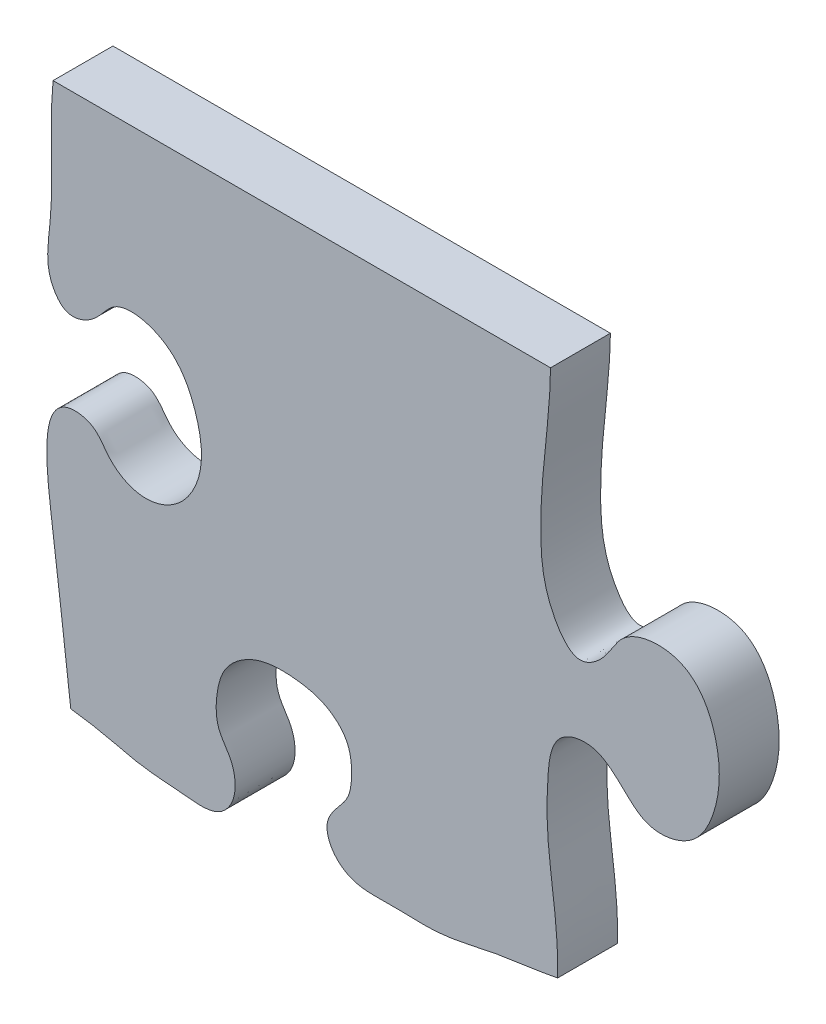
ISO-10303-21;
HEADER;
FILE_DESCRIPTION(('STEP AP214'),'2;1');
FILE_NAME('part.step','',(''),(''),'','','');
FILE_SCHEMA(('AUTOMOTIVE_DESIGN { 1 0 10303 214 1 1 1 1 }'));
ENDSEC;
DATA;
#1=APPLICATION_CONTEXT('core data for automotive mechanical design processes');
#2=APPLICATION_PROTOCOL_DEFINITION('international standard','automotive_design',2000,#1);
#3=PRODUCT_CONTEXT('',#1,'mechanical');
#4=PRODUCT('Part','Part','',(#3));
#5=PRODUCT_RELATED_PRODUCT_CATEGORY('part','',(#4));
#6=PRODUCT_DEFINITION_FORMATION('','',#4);
#7=PRODUCT_DEFINITION_CONTEXT('part definition',#1,'design');
#8=PRODUCT_DEFINITION('design','',#6,#7);
#9=PRODUCT_DEFINITION_SHAPE('','',#8);
#10=(LENGTH_UNIT() NAMED_UNIT(*) SI_UNIT(.MILLI.,.METRE.));
#11=(NAMED_UNIT(*) PLANE_ANGLE_UNIT() SI_UNIT($,.RADIAN.));
#12=(NAMED_UNIT(*) SI_UNIT($,.STERADIAN.) SOLID_ANGLE_UNIT());
#13=UNCERTAINTY_MEASURE_WITH_UNIT(LENGTH_MEASURE(1.E-05),#10,'distance_accuracy_value','');
#14=(GEOMETRIC_REPRESENTATION_CONTEXT(3) GLOBAL_UNCERTAINTY_ASSIGNED_CONTEXT((#13)) GLOBAL_UNIT_ASSIGNED_CONTEXT((#10,
#11,#12)) REPRESENTATION_CONTEXT('',''));
#15=CARTESIAN_POINT('',(0.,0.,0.));
#16=DIRECTION('',(0.,0.,1.));
#17=DIRECTION('',(1.,0.,0.));
#18=AXIS2_PLACEMENT_3D('',#15,#16,#17);
#19=CARTESIAN_POINT('',(-186.393246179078,356.,-0.00999999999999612));
#20=CARTESIAN_POINT('',(-186.465644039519,346.788250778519,-0.00999999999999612));
#21=CARTESIAN_POINT('',(-188.628884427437,329.478394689,-0.00999999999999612));
#22=CARTESIAN_POINT('',(-190.429976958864,304.816732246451,-0.00999999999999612));
#23=CARTESIAN_POINT('',(-187.884620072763,287.022607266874,-0.00999999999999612));
#24=CARTESIAN_POINT('',(-177.83183487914,273.701157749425,-0.00999999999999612));
#25=CARTESIAN_POINT('',(-167.372440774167,281.069990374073,-0.00999999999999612));
#26=CARTESIAN_POINT('',(-162.424812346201,293.671302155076,-0.00999999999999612));
#27=CARTESIAN_POINT('',(-138.980403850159,295.954762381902,-0.00999999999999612));
#28=CARTESIAN_POINT('',(-129.023505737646,274.502332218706,-0.00999999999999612));
#29=CARTESIAN_POINT('',(-130.151753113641,256.130310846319,-0.00999999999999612));
#30=CARTESIAN_POINT('',(-138.180313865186,240.882815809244,-0.00999999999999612));
#31=CARTESIAN_POINT('',(-153.903325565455,237.974697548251,-0.00999999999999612));
#32=CARTESIAN_POINT('',(-162.781582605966,247.270783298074,-0.00999999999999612));
#33=CARTESIAN_POINT('',(-171.61954140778,254.983724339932,-0.00999999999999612));
#34=CARTESIAN_POINT('',(-186.267660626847,251.663377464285,-0.00999999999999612));
#35=CARTESIAN_POINT('',(-188.178219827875,226.271427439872,-0.00999999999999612));
#36=CARTESIAN_POINT('',(-186.828985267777,214.10322906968,-0.00999999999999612));
#37=CARTESIAN_POINT('',(-182.631402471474,181.666904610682,-0.00999999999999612));
#38=CARTESIAN_POINT('',(-187.119801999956,157.75465666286,-0.00999999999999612));
#39=CARTESIAN_POINT('',(-187.457937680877,142.904539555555,-0.00999999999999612));
#40=CARTESIAN_POINT('',(-184.089404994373,126.204275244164,-0.00999999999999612));
#41=CARTESIAN_POINT('',(-168.499206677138,126.488047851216,-0.00999999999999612));
#42=CARTESIAN_POINT('',(-158.423592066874,136.759079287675,-0.00999999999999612));
#43=CARTESIAN_POINT('',(-133.598254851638,130.460350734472,-0.00999999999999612));
#44=CARTESIAN_POINT('',(-132.174041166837,109.25711139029,-0.00999999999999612));
#45=CARTESIAN_POINT('',(-137.401430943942,84.0677449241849,-0.00999999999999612));
#46=CARTESIAN_POINT('',(-159.905312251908,82.8448138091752,-0.00999999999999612));
#47=CARTESIAN_POINT('',(-167.594499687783,95.2630828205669,-0.00999999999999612));
#48=CARTESIAN_POINT('',(-184.064608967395,90.371493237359,-0.00999999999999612));
#49=CARTESIAN_POINT('',(-186.999172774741,63.1173196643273,-0.00999999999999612));
#50=CARTESIAN_POINT('',(-188.17555036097,34.3474510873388,-0.00999999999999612));
#51=CARTESIAN_POINT('',(-189.520016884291,-1.94344937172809,-0.00999999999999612));
#52=CARTESIAN_POINT('',(-192.230906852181,-38.9111914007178,-0.00999999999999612));
#53=CARTESIAN_POINT('',(-193.196462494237,-56.4819013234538,-0.00999999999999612));
#54=CARTESIAN_POINT('',(-187.787083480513,-81.0819408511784,-0.00999999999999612));
#55=CARTESIAN_POINT('',(-174.027975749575,-78.613025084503,-0.00999999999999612));
#56=CARTESIAN_POINT('',(-167.64120428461,-66.7586676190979,-0.00999999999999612));
#57=CARTESIAN_POINT('',(-138.878579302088,-69.8200733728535,-0.00999999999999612));
#58=CARTESIAN_POINT('',(-138.315063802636,-94.39593724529,-0.00999999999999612));
#59=CARTESIAN_POINT('',(-145.951566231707,-114.49908529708,-0.00999999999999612));
#60=CARTESIAN_POINT('',(-163.555921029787,-121.175747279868,-0.00999999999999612));
#61=CARTESIAN_POINT('',(-172.11578880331,-114.919909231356,-0.00999999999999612));
#62=CARTESIAN_POINT('',(-176.485425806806,-107.364168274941,-0.00999999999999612));
#63=CARTESIAN_POINT('',(-184.309097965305,-107.607264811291,-0.00999999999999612));
#64=CARTESIAN_POINT('',(-188.561946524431,-116.100575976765,-0.00999999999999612));
#65=CARTESIAN_POINT('',(-189.834439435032,-132.751458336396,-0.00999999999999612));
#66=CARTESIAN_POINT('',(-188.899668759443,-143.69775261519,-0.00999999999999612));
#67=CARTESIAN_POINT('',(-186.87437190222,-176.639875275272,-0.00999999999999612));
#68=CARTESIAN_POINT('',(-187.115886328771,-188.95785352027,-0.00999999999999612));
#69=CARTESIAN_POINT('',(-184.068917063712,-208.490912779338,-0.00999999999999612));
#70=CARTESIAN_POINT('',(-184.462371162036,-228.434350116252,-0.00999999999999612));
#71=CARTESIAN_POINT('',(-182.717405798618,-241.744671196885,-0.00999999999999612));
#72=CARTESIAN_POINT('',(-190.107123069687,-258.646375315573,-0.00999999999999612));
#73=CARTESIAN_POINT('',(-204.50360377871,-253.849993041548,-0.00999999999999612));
#74=CARTESIAN_POINT('',(-211.768269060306,-241.698033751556,-0.00999999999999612));
#75=CARTESIAN_POINT('',(-230.141572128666,-243.165284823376,-0.00999999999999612));
#76=CARTESIAN_POINT('',(-238.864067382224,-259.702852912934,-0.00999999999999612));
#77=CARTESIAN_POINT('',(-237.82033634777,-276.944530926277,-0.00999999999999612));
#78=CARTESIAN_POINT('',(-229.688332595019,-293.402921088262,-0.00999999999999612));
#79=CARTESIAN_POINT('',(-210.804716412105,-298.51720908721,-0.00999999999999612));
#80=CARTESIAN_POINT('',(-204.725260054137,-287.600226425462,-0.00999999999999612));
#81=CARTESIAN_POINT('',(-198.130842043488,-278.388409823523,-0.00999999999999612));
#82=CARTESIAN_POINT('',(-189.724281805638,-288.428094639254,-0.00999999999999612));
#83=CARTESIAN_POINT('',(-185.110914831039,-304.121783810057,-0.00999999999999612));
#84=CARTESIAN_POINT('',(-188.504639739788,-328.326605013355,-0.00999999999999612));
#85=CARTESIAN_POINT('',(-188.031330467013,-347.655914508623,-0.00999999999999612));
#86=CARTESIAN_POINT('',(-188.197680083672,-356.,-0.00999999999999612));
#87=B_SPLINE_CURVE_WITH_KNOTS('',3,(#19,#20,#21,#22,#23,#24,#25,#26,#27,#28,#29,#30,#31,#32,#33,
#34,#35,#36,#37,#38,#39,#40,#41,#42,#43,#44,#45,#46,#47,#48,#49,#50,#51,#52,#53,#54,#55,#56,#57,
#58,#59,#60,#61,#62,#63,#64,#65,#66,#67,#68,#69,#70,#71,#72,#73,#74,#75,#76,#77,#78,#79,#80,#81,
#82,#83,#84,#85,#86),.UNSPECIFIED.,.F.,.F.,(4,1,1,1,1,1,1,1,1,1,1,1,1,1,1,1,1,1,1,1,1,1,1,1,1,1,
1,1,1,1,1,1,1,1,1,1,1,1,1,1,1,1,1,1,1,1,1,1,1,1,1,1,1,1,1,1,1,1,1,1,1,1,1,1,1,4),(0.,
0.0262331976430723,0.050560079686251,0.0695219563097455,0.0800713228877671,0.0885051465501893,
0.099482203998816,0.118619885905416,0.138837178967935,0.157899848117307,0.171291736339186,
0.185151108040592,0.19559453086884,0.206745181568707,0.217337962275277,0.230877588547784,
0.26409725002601,0.28835141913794,0.305292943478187,0.32505690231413,0.334743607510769,
0.348191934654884,0.358741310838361,0.375812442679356,0.401272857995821,0.416827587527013,
0.432882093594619,0.444490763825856,0.458014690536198,0.481063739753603,0.510647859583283,
0.548186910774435,0.587648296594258,0.610908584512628,0.621783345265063,0.631931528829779,
0.643591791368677,0.658807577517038,0.686126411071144,0.703957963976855,0.718649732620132,
0.731300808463,0.735266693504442,0.736591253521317,0.743662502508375,0.746501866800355,
0.76410099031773,0.785041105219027,0.790214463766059,0.812987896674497,0.817887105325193,
0.836359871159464,0.84408330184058,0.853053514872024,0.86313504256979,0.875355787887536,
0.885829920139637,0.902341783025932,0.912788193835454,0.926625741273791,0.934943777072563,
0.940543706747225,0.946912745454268,0.957064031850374,0.980148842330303,1.),.UNSPECIFIED.);
#88=DIRECTION('',(0.,0.,1.));
#89=VECTOR('',#88,1.);
#90=SURFACE_OF_LINEAR_EXTRUSION('',#87,#89);
#91=DIRECTION('',(0.,0.,1.));
#92=VECTOR('',#91,1.);
#93=CARTESIAN_POINT('',(-184.013210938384,180.695478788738,-0.00999999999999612));
#94=LINE('',#93,#92);
#95=CARTESIAN_POINT('',(-184.013210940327,180.695478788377,20.));
#96=VERTEX_POINT('',#95);
#97=CARTESIAN_POINT('',(-184.013210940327,180.695478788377,0.));
#98=VERTEX_POINT('',#97);
#99=EDGE_CURVE('E84',#96,#98,#94,.F.);
#100=ORIENTED_EDGE('',*,*,#99,.T.);
#101=CARTESIAN_POINT('',(-186.393246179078,356.,0.));
#102=CARTESIAN_POINT('',(-186.465644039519,346.788250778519,0.));
#103=CARTESIAN_POINT('',(-188.628884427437,329.478394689,0.));
#104=CARTESIAN_POINT('',(-190.429976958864,304.816732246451,0.));
#105=CARTESIAN_POINT('',(-187.884620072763,287.022607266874,0.));
#106=CARTESIAN_POINT('',(-177.83183487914,273.701157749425,0.));
#107=CARTESIAN_POINT('',(-167.372440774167,281.069990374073,0.));
#108=CARTESIAN_POINT('',(-162.424812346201,293.671302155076,0.));
#109=CARTESIAN_POINT('',(-138.980403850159,295.954762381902,0.));
#110=CARTESIAN_POINT('',(-129.023505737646,274.502332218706,0.));
#111=CARTESIAN_POINT('',(-130.151753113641,256.130310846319,0.));
#112=CARTESIAN_POINT('',(-138.180313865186,240.882815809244,0.));
#113=CARTESIAN_POINT('',(-153.903325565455,237.974697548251,0.));
#114=CARTESIAN_POINT('',(-162.781582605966,247.270783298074,0.));
#115=CARTESIAN_POINT('',(-171.61954140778,254.983724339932,0.));
#116=CARTESIAN_POINT('',(-186.267660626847,251.663377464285,0.));
#117=CARTESIAN_POINT('',(-188.178219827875,226.271427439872,0.));
#118=CARTESIAN_POINT('',(-186.828985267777,214.10322906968,0.));
#119=CARTESIAN_POINT('',(-182.631402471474,181.666904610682,0.));
#120=CARTESIAN_POINT('',(-187.119801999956,157.75465666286,0.));
#121=CARTESIAN_POINT('',(-187.457937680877,142.904539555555,0.));
#122=CARTESIAN_POINT('',(-184.089404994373,126.204275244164,0.));
#123=CARTESIAN_POINT('',(-168.499206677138,126.488047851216,0.));
#124=CARTESIAN_POINT('',(-158.423592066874,136.759079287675,0.));
#125=CARTESIAN_POINT('',(-133.598254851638,130.460350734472,0.));
#126=CARTESIAN_POINT('',(-132.174041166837,109.25711139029,0.));
#127=CARTESIAN_POINT('',(-137.401430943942,84.0677449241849,0.));
#128=CARTESIAN_POINT('',(-159.905312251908,82.8448138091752,0.));
#129=CARTESIAN_POINT('',(-167.594499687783,95.2630828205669,0.));
#130=CARTESIAN_POINT('',(-184.064608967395,90.371493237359,0.));
#131=CARTESIAN_POINT('',(-186.999172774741,63.1173196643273,0.));
#132=CARTESIAN_POINT('',(-188.17555036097,34.3474510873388,0.));
#133=CARTESIAN_POINT('',(-189.520016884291,-1.94344937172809,0.));
#134=CARTESIAN_POINT('',(-192.230906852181,-38.9111914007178,0.));
#135=CARTESIAN_POINT('',(-193.196462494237,-56.4819013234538,0.));
#136=CARTESIAN_POINT('',(-187.787083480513,-81.0819408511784,0.));
#137=CARTESIAN_POINT('',(-174.027975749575,-78.613025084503,0.));
#138=CARTESIAN_POINT('',(-167.64120428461,-66.7586676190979,0.));
#139=CARTESIAN_POINT('',(-138.878579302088,-69.8200733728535,0.));
#140=CARTESIAN_POINT('',(-138.315063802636,-94.39593724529,0.));
#141=CARTESIAN_POINT('',(-145.951566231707,-114.49908529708,0.));
#142=CARTESIAN_POINT('',(-163.555921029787,-121.175747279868,0.));
#143=CARTESIAN_POINT('',(-172.11578880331,-114.919909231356,0.));
#144=CARTESIAN_POINT('',(-176.485425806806,-107.364168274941,0.));
#145=CARTESIAN_POINT('',(-184.309097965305,-107.607264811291,0.));
#146=CARTESIAN_POINT('',(-188.561946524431,-116.100575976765,0.));
#147=CARTESIAN_POINT('',(-189.834439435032,-132.751458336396,0.));
#148=CARTESIAN_POINT('',(-188.899668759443,-143.69775261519,0.));
#149=CARTESIAN_POINT('',(-186.87437190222,-176.639875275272,0.));
#150=CARTESIAN_POINT('',(-187.115886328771,-188.95785352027,0.));
#151=CARTESIAN_POINT('',(-184.068917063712,-208.490912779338,0.));
#152=CARTESIAN_POINT('',(-184.462371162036,-228.434350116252,0.));
#153=CARTESIAN_POINT('',(-182.717405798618,-241.744671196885,0.));
#154=CARTESIAN_POINT('',(-190.107123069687,-258.646375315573,0.));
#155=CARTESIAN_POINT('',(-204.50360377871,-253.849993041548,0.));
#156=CARTESIAN_POINT('',(-211.768269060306,-241.698033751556,0.));
#157=CARTESIAN_POINT('',(-230.141572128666,-243.165284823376,0.));
#158=CARTESIAN_POINT('',(-238.864067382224,-259.702852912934,0.));
#159=CARTESIAN_POINT('',(-237.82033634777,-276.944530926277,0.));
#160=CARTESIAN_POINT('',(-229.688332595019,-293.402921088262,0.));
#161=CARTESIAN_POINT('',(-210.804716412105,-298.51720908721,0.));
#162=CARTESIAN_POINT('',(-204.725260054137,-287.600226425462,0.));
#163=CARTESIAN_POINT('',(-198.130842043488,-278.388409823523,0.));
#164=CARTESIAN_POINT('',(-189.724281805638,-288.428094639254,0.));
#165=CARTESIAN_POINT('',(-185.110914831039,-304.121783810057,0.));
#166=CARTESIAN_POINT('',(-188.504639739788,-328.326605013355,0.));
#167=CARTESIAN_POINT('',(-188.031330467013,-347.655914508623,0.));
#168=CARTESIAN_POINT('',(-188.197680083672,-356.,0.));
#169=B_SPLINE_CURVE_WITH_KNOTS('',3,(#101,#102,#103,#104,#105,#106,#107,#108,#109,#110,#111,
#112,#113,#114,#115,#116,#117,#118,#119,#120,#121,#122,#123,#124,#125,#126,#127,#128,#129,#130,
#131,#132,#133,#134,#135,#136,#137,#138,#139,#140,#141,#142,#143,#144,#145,#146,#147,#148,#149,
#150,#151,#152,#153,#154,#155,#156,#157,#158,#159,#160,#161,#162,#163,#164,#165,#166,#167,#168),
.UNSPECIFIED.,.F.,.F.,(4,1,1,1,1,1,1,1,1,1,1,1,1,1,1,1,1,1,1,1,1,1,1,1,1,1,1,1,1,1,1,1,1,1,1,1,
1,1,1,1,1,1,1,1,1,1,1,1,1,1,1,1,1,1,1,1,1,1,1,1,1,1,1,1,1,4),(0.,0.0262331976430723,
0.050560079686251,0.0695219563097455,0.0800713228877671,0.0885051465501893,0.099482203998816,
0.118619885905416,0.138837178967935,0.157899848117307,0.171291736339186,0.185151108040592,
0.19559453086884,0.206745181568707,0.217337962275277,0.230877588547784,0.26409725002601,
0.28835141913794,0.305292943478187,0.32505690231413,0.334743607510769,0.348191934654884,
0.358741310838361,0.375812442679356,0.401272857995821,0.416827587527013,0.432882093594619,
0.444490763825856,0.458014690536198,0.481063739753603,0.510647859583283,0.548186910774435,
0.587648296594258,0.610908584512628,0.621783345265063,0.631931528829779,0.643591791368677,
0.658807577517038,0.686126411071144,0.703957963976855,0.718649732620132,0.731300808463,
0.735266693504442,0.736591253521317,0.743662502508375,0.746501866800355,0.76410099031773,
0.785041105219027,0.790214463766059,0.812987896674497,0.817887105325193,0.836359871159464,
0.84408330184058,0.853053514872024,0.86313504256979,0.875355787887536,0.885829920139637,
0.902341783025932,0.912788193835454,0.926625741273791,0.934943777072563,0.940543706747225,
0.946912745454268,0.957064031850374,0.980148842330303,1.),.UNSPECIFIED.);
#170=CARTESIAN_POINT('',(-186.393246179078,356.,0.));
#171=VERTEX_POINT('',#170);
#172=EDGE_CURVE('E90',#171,#98,#169,.T.);
#173=ORIENTED_EDGE('',*,*,#172,.F.);
#174=DIRECTION('',(0.,0.,1.));
#175=VECTOR('',#174,1.);
#176=CARTESIAN_POINT('',(-186.393246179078,356.,-0.00999999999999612));
#177=LINE('',#176,#175);
#178=CARTESIAN_POINT('',(-186.393246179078,356.,20.));
#179=VERTEX_POINT('',#178);
#180=EDGE_CURVE('E59',#179,#171,#177,.F.);
#181=ORIENTED_EDGE('',*,*,#180,.F.);
#182=CARTESIAN_POINT('',(-186.393246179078,356.,20.));
#183=CARTESIAN_POINT('',(-186.465644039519,346.788250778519,20.));
#184=CARTESIAN_POINT('',(-188.628884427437,329.478394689,20.));
#185=CARTESIAN_POINT('',(-190.429976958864,304.816732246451,20.));
#186=CARTESIAN_POINT('',(-187.884620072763,287.022607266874,20.));
#187=CARTESIAN_POINT('',(-177.83183487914,273.701157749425,20.));
#188=CARTESIAN_POINT('',(-167.372440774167,281.069990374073,20.));
#189=CARTESIAN_POINT('',(-162.424812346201,293.671302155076,20.));
#190=CARTESIAN_POINT('',(-138.980403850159,295.954762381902,20.));
#191=CARTESIAN_POINT('',(-129.023505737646,274.502332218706,20.));
#192=CARTESIAN_POINT('',(-130.151753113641,256.130310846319,20.));
#193=CARTESIAN_POINT('',(-138.180313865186,240.882815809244,20.));
#194=CARTESIAN_POINT('',(-153.903325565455,237.974697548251,20.));
#195=CARTESIAN_POINT('',(-162.781582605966,247.270783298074,20.));
#196=CARTESIAN_POINT('',(-171.61954140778,254.983724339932,20.));
#197=CARTESIAN_POINT('',(-186.267660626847,251.663377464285,20.));
#198=CARTESIAN_POINT('',(-188.178219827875,226.271427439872,20.));
#199=CARTESIAN_POINT('',(-186.828985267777,214.10322906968,20.));
#200=CARTESIAN_POINT('',(-182.631402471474,181.666904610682,20.));
#201=CARTESIAN_POINT('',(-187.119801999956,157.75465666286,20.));
#202=CARTESIAN_POINT('',(-187.457937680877,142.904539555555,20.));
#203=CARTESIAN_POINT('',(-184.089404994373,126.204275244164,20.));
#204=CARTESIAN_POINT('',(-168.499206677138,126.488047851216,20.));
#205=CARTESIAN_POINT('',(-158.423592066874,136.759079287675,20.));
#206=CARTESIAN_POINT('',(-133.598254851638,130.460350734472,20.));
#207=CARTESIAN_POINT('',(-132.174041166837,109.25711139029,20.));
#208=CARTESIAN_POINT('',(-137.401430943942,84.0677449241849,20.));
#209=CARTESIAN_POINT('',(-159.905312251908,82.8448138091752,20.));
#210=CARTESIAN_POINT('',(-167.594499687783,95.2630828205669,20.));
#211=CARTESIAN_POINT('',(-184.064608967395,90.371493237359,20.));
#212=CARTESIAN_POINT('',(-186.999172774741,63.1173196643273,20.));
#213=CARTESIAN_POINT('',(-188.17555036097,34.3474510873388,20.));
#214=CARTESIAN_POINT('',(-189.520016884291,-1.94344937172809,20.));
#215=CARTESIAN_POINT('',(-192.230906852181,-38.9111914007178,20.));
#216=CARTESIAN_POINT('',(-193.196462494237,-56.4819013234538,20.));
#217=CARTESIAN_POINT('',(-187.787083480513,-81.0819408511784,20.));
#218=CARTESIAN_POINT('',(-174.027975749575,-78.613025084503,20.));
#219=CARTESIAN_POINT('',(-167.64120428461,-66.7586676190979,20.));
#220=CARTESIAN_POINT('',(-138.878579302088,-69.8200733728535,20.));
#221=CARTESIAN_POINT('',(-138.315063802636,-94.39593724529,20.));
#222=CARTESIAN_POINT('',(-145.951566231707,-114.49908529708,20.));
#223=CARTESIAN_POINT('',(-163.555921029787,-121.175747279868,20.));
#224=CARTESIAN_POINT('',(-172.11578880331,-114.919909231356,20.));
#225=CARTESIAN_POINT('',(-176.485425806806,-107.364168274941,20.));
#226=CARTESIAN_POINT('',(-184.309097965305,-107.607264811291,20.));
#227=CARTESIAN_POINT('',(-188.561946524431,-116.100575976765,20.));
#228=CARTESIAN_POINT('',(-189.834439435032,-132.751458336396,20.));
#229=CARTESIAN_POINT('',(-188.899668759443,-143.69775261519,20.));
#230=CARTESIAN_POINT('',(-186.87437190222,-176.639875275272,20.));
#231=CARTESIAN_POINT('',(-187.115886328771,-188.95785352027,20.));
#232=CARTESIAN_POINT('',(-184.068917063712,-208.490912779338,20.));
#233=CARTESIAN_POINT('',(-184.462371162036,-228.434350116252,20.));
#234=CARTESIAN_POINT('',(-182.717405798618,-241.744671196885,20.));
#235=CARTESIAN_POINT('',(-190.107123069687,-258.646375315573,20.));
#236=CARTESIAN_POINT('',(-204.50360377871,-253.849993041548,20.));
#237=CARTESIAN_POINT('',(-211.768269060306,-241.698033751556,20.));
#238=CARTESIAN_POINT('',(-230.141572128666,-243.165284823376,20.));
#239=CARTESIAN_POINT('',(-238.864067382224,-259.702852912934,20.));
#240=CARTESIAN_POINT('',(-237.82033634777,-276.944530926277,20.));
#241=CARTESIAN_POINT('',(-229.688332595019,-293.402921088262,20.));
#242=CARTESIAN_POINT('',(-210.804716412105,-298.51720908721,20.));
#243=CARTESIAN_POINT('',(-204.725260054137,-287.600226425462,20.));
#244=CARTESIAN_POINT('',(-198.130842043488,-278.388409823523,20.));
#245=CARTESIAN_POINT('',(-189.724281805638,-288.428094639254,20.));
#246=CARTESIAN_POINT('',(-185.110914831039,-304.121783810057,20.));
#247=CARTESIAN_POINT('',(-188.504639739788,-328.326605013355,20.));
#248=CARTESIAN_POINT('',(-188.031330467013,-347.655914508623,20.));
#249=CARTESIAN_POINT('',(-188.197680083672,-356.,20.));
#250=B_SPLINE_CURVE_WITH_KNOTS('',3,(#182,#183,#184,#185,#186,#187,#188,#189,#190,#191,#192,
#193,#194,#195,#196,#197,#198,#199,#200,#201,#202,#203,#204,#205,#206,#207,#208,#209,#210,#211,
#212,#213,#214,#215,#216,#217,#218,#219,#220,#221,#222,#223,#224,#225,#226,#227,#228,#229,#230,
#231,#232,#233,#234,#235,#236,#237,#238,#239,#240,#241,#242,#243,#244,#245,#246,#247,#248,#249),
.UNSPECIFIED.,.F.,.F.,(4,1,1,1,1,1,1,1,1,1,1,1,1,1,1,1,1,1,1,1,1,1,1,1,1,1,1,1,1,1,1,1,1,1,1,1,
1,1,1,1,1,1,1,1,1,1,1,1,1,1,1,1,1,1,1,1,1,1,1,1,1,1,1,1,1,4),(0.,0.0262331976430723,
0.050560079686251,0.0695219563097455,0.0800713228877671,0.0885051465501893,0.099482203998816,
0.118619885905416,0.138837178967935,0.157899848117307,0.171291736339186,0.185151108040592,
0.19559453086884,0.206745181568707,0.217337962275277,0.230877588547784,0.26409725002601,
0.28835141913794,0.305292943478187,0.32505690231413,0.334743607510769,0.348191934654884,
0.358741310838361,0.375812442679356,0.401272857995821,0.416827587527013,0.432882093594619,
0.444490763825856,0.458014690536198,0.481063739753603,0.510647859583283,0.548186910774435,
0.587648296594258,0.610908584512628,0.621783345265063,0.631931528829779,0.643591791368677,
0.658807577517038,0.686126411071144,0.703957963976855,0.718649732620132,0.731300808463,
0.735266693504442,0.736591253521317,0.743662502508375,0.746501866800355,0.76410099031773,
0.785041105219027,0.790214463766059,0.812987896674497,0.817887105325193,0.836359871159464,
0.84408330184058,0.853053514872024,0.86313504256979,0.875355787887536,0.885829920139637,
0.902341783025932,0.912788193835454,0.926625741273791,0.934943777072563,0.940543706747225,
0.946912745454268,0.957064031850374,0.980148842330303,1.),.UNSPECIFIED.);
#251=EDGE_CURVE('E96',#179,#96,#250,.T.);
#252=ORIENTED_EDGE('',*,*,#251,.T.);
#253=EDGE_LOOP('',(#100,#173,#181,#252));
#254=FACE_BOUND('',#253,.T.);
#255=ADVANCED_FACE('F34',(#254),#90,.F.);
#256=CARTESIAN_POINT('',(-352.534626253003,356.,-0.00999999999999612));
#257=CARTESIAN_POINT('',(-353.877781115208,341.802611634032,-0.00999999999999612));
#258=CARTESIAN_POINT('',(-351.460483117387,322.567956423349,-0.00999999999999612));
#259=CARTESIAN_POINT('',(-355.747404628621,299.493999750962,-0.00999999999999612));
#260=CARTESIAN_POINT('',(-347.645743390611,289.357079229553,-0.00999999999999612));
#261=CARTESIAN_POINT('',(-337.80105524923,293.322704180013,-0.00999999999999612));
#262=CARTESIAN_POINT('',(-331.763521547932,304.464683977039,-0.00999999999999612));
#263=CARTESIAN_POINT('',(-312.737993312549,300.417040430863,-0.00999999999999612));
#264=CARTESIAN_POINT('',(-304.311514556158,284.867329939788,-0.00999999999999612));
#265=CARTESIAN_POINT('',(-301.362858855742,267.518539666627,-0.00999999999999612));
#266=CARTESIAN_POINT('',(-309.525260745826,253.299800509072,-0.00999999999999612));
#267=CARTESIAN_POINT('',(-323.085028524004,249.130779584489,-0.00999999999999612));
#268=CARTESIAN_POINT('',(-333.558735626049,254.453066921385,-0.00999999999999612));
#269=CARTESIAN_POINT('',(-338.061007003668,263.306234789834,-0.00999999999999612));
#270=CARTESIAN_POINT('',(-357.610347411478,266.663664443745,-0.00999999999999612));
#271=CARTESIAN_POINT('',(-352.91397083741,227.568949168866,-0.00999999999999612));
#272=CARTESIAN_POINT('',(-349.689076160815,203.209436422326,-0.00999999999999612));
#273=CARTESIAN_POINT('',(-346.386977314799,175.800103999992,-0.00999999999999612));
#274=CARTESIAN_POINT('',(-343.691373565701,150.269708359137,-0.00999999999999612));
#275=CARTESIAN_POINT('',(-342.931567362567,128.594211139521,-0.00999999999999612));
#276=CARTESIAN_POINT('',(-343.655360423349,107.633085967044,-0.00999999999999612));
#277=CARTESIAN_POINT('',(-357.389603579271,103.824438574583,-0.00999999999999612));
#278=CARTESIAN_POINT('',(-367.576419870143,106.015828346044,-0.00999999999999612));
#279=CARTESIAN_POINT('',(-371.765750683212,114.589953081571,-0.00999999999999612));
#280=CARTESIAN_POINT('',(-382.535012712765,116.182843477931,-0.00999999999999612));
#281=CARTESIAN_POINT('',(-394.783984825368,115.916744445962,-0.00999999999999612));
#282=CARTESIAN_POINT('',(-402.322369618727,104.396558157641,-0.00999999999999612));
#283=CARTESIAN_POINT('',(-405.688784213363,89.1486295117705,-0.00999999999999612));
#284=CARTESIAN_POINT('',(-402.964002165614,71.2455616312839,-0.00999999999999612));
#285=CARTESIAN_POINT('',(-389.022909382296,60.8761001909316,-0.00999999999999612));
#286=CARTESIAN_POINT('',(-377.013010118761,63.0649709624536,-0.00999999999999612));
#287=CARTESIAN_POINT('',(-370.136212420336,70.9200889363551,-0.00999999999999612));
#288=CARTESIAN_POINT('',(-359.248489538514,74.3793713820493,-0.00999999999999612));
#289=CARTESIAN_POINT('',(-347.964757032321,70.4189230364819,-0.00999999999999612));
#290=CARTESIAN_POINT('',(-342.961480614,58.8762689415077,-0.00999999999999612));
#291=CARTESIAN_POINT('',(-344.957853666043,42.6141567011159,-0.00999999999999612));
#292=CARTESIAN_POINT('',(-348.090347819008,20.9428011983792,-0.00999999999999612));
#293=CARTESIAN_POINT('',(-348.787112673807,-1.92187291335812,-0.00999999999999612));
#294=CARTESIAN_POINT('',(-347.063507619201,-23.1354473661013,-0.00999999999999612));
#295=CARTESIAN_POINT('',(-345.803834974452,-40.1989543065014,-0.00999999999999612));
#296=CARTESIAN_POINT('',(-346.365109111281,-52.5147126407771,-0.00999999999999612));
#297=CARTESIAN_POINT('',(-346.987719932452,-61.0081322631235,-0.00999999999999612));
#298=CARTESIAN_POINT('',(-354.605588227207,-67.8105997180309,-0.00999999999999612));
#299=CARTESIAN_POINT('',(-368.483652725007,-69.9483525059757,-0.00999999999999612));
#300=CARTESIAN_POINT('',(-374.929468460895,-56.6181815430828,-0.00999999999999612));
#301=CARTESIAN_POINT('',(-389.51528778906,-54.9578642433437,-0.00999999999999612));
#302=CARTESIAN_POINT('',(-403.927113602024,-62.7741481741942,-0.00999999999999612));
#303=CARTESIAN_POINT('',(-408.906740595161,-79.6272624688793,-0.00999999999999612));
#304=CARTESIAN_POINT('',(-407.354009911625,-95.181625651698,-0.00999999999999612));
#305=CARTESIAN_POINT('',(-399.108136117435,-108.127376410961,-0.00999999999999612));
#306=CARTESIAN_POINT('',(-382.721304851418,-112.332091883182,-0.00999999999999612));
#307=CARTESIAN_POINT('',(-372.627066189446,-99.6029758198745,-0.00999999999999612));
#308=CARTESIAN_POINT('',(-359.245942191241,-98.6507630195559,-0.00999999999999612));
#309=CARTESIAN_POINT('',(-346.811479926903,-105.357996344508,-0.00999999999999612));
#310=CARTESIAN_POINT('',(-347.06309899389,-122.824759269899,-0.00999999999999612));
#311=CARTESIAN_POINT('',(-349.512128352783,-142.867981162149,-0.00999999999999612));
#312=CARTESIAN_POINT('',(-351.967561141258,-164.813498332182,-0.00999999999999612));
#313=CARTESIAN_POINT('',(-354.173348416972,-189.531702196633,-0.00999999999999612));
#314=CARTESIAN_POINT('',(-353.048503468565,-212.668893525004,-0.00999999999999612));
#315=CARTESIAN_POINT('',(-354.739062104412,-232.840407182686,-0.00999999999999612));
#316=CARTESIAN_POINT('',(-344.245211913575,-244.921596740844,-0.00999999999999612));
#317=CARTESIAN_POINT('',(-336.376475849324,-237.735778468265,-0.00999999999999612));
#318=CARTESIAN_POINT('',(-333.938993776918,-228.321764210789,-0.00999999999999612));
#319=CARTESIAN_POINT('',(-321.423877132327,-226.689197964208,-0.00999999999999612));
#320=CARTESIAN_POINT('',(-310.83224361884,-232.911014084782,-0.00999999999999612));
#321=CARTESIAN_POINT('',(-302.540379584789,-246.611975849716,-0.00999999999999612));
#322=CARTESIAN_POINT('',(-304.049270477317,-262.348985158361,-0.00999999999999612));
#323=CARTESIAN_POINT('',(-307.19247660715,-276.895908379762,-0.00999999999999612));
#324=CARTESIAN_POINT('',(-317.916754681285,-281.774853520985,-0.00999999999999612));
#325=CARTESIAN_POINT('',(-328.48323529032,-282.130896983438,-0.00999999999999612));
#326=CARTESIAN_POINT('',(-335.177873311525,-274.391757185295,-0.00999999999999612));
#327=CARTESIAN_POINT('',(-340.967044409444,-267.020526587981,-0.00999999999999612));
#328=CARTESIAN_POINT('',(-352.493784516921,-268.657509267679,-0.00999999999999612));
#329=CARTESIAN_POINT('',(-357.686319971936,-282.822093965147,-0.00999999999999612));
#330=CARTESIAN_POINT('',(-357.597756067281,-311.53856504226,-0.00999999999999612));
#331=CARTESIAN_POINT('',(-355.656952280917,-337.76537977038,-0.00999999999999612));
#332=CARTESIAN_POINT('',(-354.035135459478,-356.,-0.00999999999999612));
#333=B_SPLINE_CURVE_WITH_KNOTS('',3,(#256,#257,#258,#259,#260,#261,#262,#263,#264,#265,#266,
#267,#268,#269,#270,#271,#272,#273,#274,#275,#276,#277,#278,#279,#280,#281,#282,#283,#284,#285,
#286,#287,#288,#289,#290,#291,#292,#293,#294,#295,#296,#297,#298,#299,#300,#301,#302,#303,#304,
#305,#306,#307,#308,#309,#310,#311,#312,#313,#314,#315,#316,#317,#318,#319,#320,#321,#322,#323,
#324,#325,#326,#327,#328,#329,#330,#331,#332),.UNSPECIFIED.,.F.,.F.,(4,1,1,1,1,1,1,1,1,1,1,1,1,
1,1,1,1,1,1,1,1,1,1,1,1,1,1,1,1,1,1,1,1,1,1,1,1,1,1,1,1,1,1,1,1,1,1,1,1,1,1,1,1,1,1,1,1,1,1,1,1,
1,1,1,1,1,1,1,1,1,1,1,1,1,4),(0.,0.0362663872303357,0.0516957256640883,0.0575126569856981,
0.0656061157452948,0.0738542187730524,0.0886191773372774,0.103761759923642,0.118344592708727,
0.132658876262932,0.141706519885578,0.152628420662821,0.159936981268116,0.166346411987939,
0.196099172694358,0.222591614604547,0.242329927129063,0.265519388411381,0.28892287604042,
0.3014399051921,0.313339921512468,0.3200215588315,0.327007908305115,0.335496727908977,
0.346341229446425,0.356695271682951,0.367736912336,0.387395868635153,0.399447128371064,
0.408443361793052,0.416078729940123,0.425886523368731,0.4364139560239,0.44355209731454,
0.456701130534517,0.478081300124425,0.500737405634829,0.515722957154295,0.53328305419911,
0.545176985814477,0.547408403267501,0.555597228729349,0.568417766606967,0.576959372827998,
0.589646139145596,0.601337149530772,0.617107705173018,0.631663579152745,0.64088779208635,
0.655943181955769,0.666193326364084,0.679689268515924,0.687162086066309,0.700019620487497,
0.719317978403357,0.742088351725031,0.756487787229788,0.783860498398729,0.801622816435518,
0.8097052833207,0.815461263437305,0.824516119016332,0.833497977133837,0.842909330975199,
0.85562007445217,0.872330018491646,0.883598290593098,0.890881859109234,0.901363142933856,
0.908021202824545,0.916645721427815,0.924017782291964,0.933106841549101,0.95201687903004,1.),.UNSPECIFIED.);
#334=DIRECTION('',(0.,0.,1.));
#335=VECTOR('',#334,1.);
#336=SURFACE_OF_LINEAR_EXTRUSION('',#333,#335);
#337=DIRECTION('',(0.,0.,1.));
#338=VECTOR('',#337,1.);
#339=CARTESIAN_POINT('',(-346.614016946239,177.25293926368,-0.00999999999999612));
#340=LINE('',#339,#338);
#341=CARTESIAN_POINT('',(-346.614016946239,177.25293926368,0.));
#342=VERTEX_POINT('',#341);
#343=CARTESIAN_POINT('',(-346.614016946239,177.25293926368,20.));
#344=VERTEX_POINT('',#343);
#345=EDGE_CURVE('E82',#342,#344,#340,.T.);
#346=ORIENTED_EDGE('',*,*,#345,.T.);
#347=CARTESIAN_POINT('',(-352.534626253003,356.,20.));
#348=CARTESIAN_POINT('',(-353.877781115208,341.802611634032,20.));
#349=CARTESIAN_POINT('',(-351.460483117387,322.567956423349,20.));
#350=CARTESIAN_POINT('',(-355.747404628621,299.493999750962,20.));
#351=CARTESIAN_POINT('',(-347.645743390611,289.357079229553,20.));
#352=CARTESIAN_POINT('',(-337.80105524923,293.322704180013,20.));
#353=CARTESIAN_POINT('',(-331.763521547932,304.464683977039,20.));
#354=CARTESIAN_POINT('',(-312.737993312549,300.417040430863,20.));
#355=CARTESIAN_POINT('',(-304.311514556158,284.867329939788,20.));
#356=CARTESIAN_POINT('',(-301.362858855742,267.518539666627,20.));
#357=CARTESIAN_POINT('',(-309.525260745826,253.299800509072,20.));
#358=CARTESIAN_POINT('',(-323.085028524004,249.130779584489,20.));
#359=CARTESIAN_POINT('',(-333.558735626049,254.453066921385,20.));
#360=CARTESIAN_POINT('',(-338.061007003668,263.306234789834,20.));
#361=CARTESIAN_POINT('',(-357.610347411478,266.663664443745,20.));
#362=CARTESIAN_POINT('',(-352.91397083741,227.568949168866,20.));
#363=CARTESIAN_POINT('',(-349.689076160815,203.209436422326,20.));
#364=CARTESIAN_POINT('',(-346.386977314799,175.800103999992,20.));
#365=CARTESIAN_POINT('',(-343.691373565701,150.269708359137,20.));
#366=CARTESIAN_POINT('',(-342.931567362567,128.594211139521,20.));
#367=CARTESIAN_POINT('',(-343.655360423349,107.633085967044,20.));
#368=CARTESIAN_POINT('',(-357.389603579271,103.824438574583,20.));
#369=CARTESIAN_POINT('',(-367.576419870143,106.015828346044,20.));
#370=CARTESIAN_POINT('',(-371.765750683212,114.589953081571,20.));
#371=CARTESIAN_POINT('',(-382.535012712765,116.182843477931,20.));
#372=CARTESIAN_POINT('',(-394.783984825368,115.916744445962,20.));
#373=CARTESIAN_POINT('',(-402.322369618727,104.396558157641,20.));
#374=CARTESIAN_POINT('',(-405.688784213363,89.1486295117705,20.));
#375=CARTESIAN_POINT('',(-402.964002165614,71.2455616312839,20.));
#376=CARTESIAN_POINT('',(-389.022909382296,60.8761001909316,20.));
#377=CARTESIAN_POINT('',(-377.013010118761,63.0649709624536,20.));
#378=CARTESIAN_POINT('',(-370.136212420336,70.9200889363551,20.));
#379=CARTESIAN_POINT('',(-359.248489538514,74.3793713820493,20.));
#380=CARTESIAN_POINT('',(-347.964757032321,70.4189230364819,20.));
#381=CARTESIAN_POINT('',(-342.961480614,58.8762689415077,20.));
#382=CARTESIAN_POINT('',(-344.957853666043,42.6141567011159,20.));
#383=CARTESIAN_POINT('',(-348.090347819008,20.9428011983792,20.));
#384=CARTESIAN_POINT('',(-348.787112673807,-1.92187291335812,20.));
#385=CARTESIAN_POINT('',(-347.063507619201,-23.1354473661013,20.));
#386=CARTESIAN_POINT('',(-345.803834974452,-40.1989543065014,20.));
#387=CARTESIAN_POINT('',(-346.365109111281,-52.5147126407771,20.));
#388=CARTESIAN_POINT('',(-346.987719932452,-61.0081322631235,20.));
#389=CARTESIAN_POINT('',(-354.605588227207,-67.8105997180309,20.));
#390=CARTESIAN_POINT('',(-368.483652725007,-69.9483525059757,20.));
#391=CARTESIAN_POINT('',(-374.929468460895,-56.6181815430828,20.));
#392=CARTESIAN_POINT('',(-389.51528778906,-54.9578642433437,20.));
#393=CARTESIAN_POINT('',(-403.927113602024,-62.7741481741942,20.));
#394=CARTESIAN_POINT('',(-408.906740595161,-79.6272624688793,20.));
#395=CARTESIAN_POINT('',(-407.354009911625,-95.181625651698,20.));
#396=CARTESIAN_POINT('',(-399.108136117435,-108.127376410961,20.));
#397=CARTESIAN_POINT('',(-382.721304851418,-112.332091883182,20.));
#398=CARTESIAN_POINT('',(-372.627066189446,-99.6029758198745,20.));
#399=CARTESIAN_POINT('',(-359.245942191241,-98.6507630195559,20.));
#400=CARTESIAN_POINT('',(-346.811479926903,-105.357996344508,20.));
#401=CARTESIAN_POINT('',(-347.06309899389,-122.824759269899,20.));
#402=CARTESIAN_POINT('',(-349.512128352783,-142.867981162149,20.));
#403=CARTESIAN_POINT('',(-351.967561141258,-164.813498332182,20.));
#404=CARTESIAN_POINT('',(-354.173348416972,-189.531702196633,20.));
#405=CARTESIAN_POINT('',(-353.048503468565,-212.668893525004,20.));
#406=CARTESIAN_POINT('',(-354.739062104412,-232.840407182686,20.));
#407=CARTESIAN_POINT('',(-344.245211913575,-244.921596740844,20.));
#408=CARTESIAN_POINT('',(-336.376475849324,-237.735778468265,20.));
#409=CARTESIAN_POINT('',(-333.938993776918,-228.321764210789,20.));
#410=CARTESIAN_POINT('',(-321.423877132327,-226.689197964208,20.));
#411=CARTESIAN_POINT('',(-310.83224361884,-232.911014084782,20.));
#412=CARTESIAN_POINT('',(-302.540379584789,-246.611975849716,20.));
#413=CARTESIAN_POINT('',(-304.049270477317,-262.348985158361,20.));
#414=CARTESIAN_POINT('',(-307.19247660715,-276.895908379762,20.));
#415=CARTESIAN_POINT('',(-317.916754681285,-281.774853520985,20.));
#416=CARTESIAN_POINT('',(-328.48323529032,-282.130896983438,20.));
#417=CARTESIAN_POINT('',(-335.177873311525,-274.391757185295,20.));
#418=CARTESIAN_POINT('',(-340.967044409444,-267.020526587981,20.));
#419=CARTESIAN_POINT('',(-352.493784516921,-268.657509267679,20.));
#420=CARTESIAN_POINT('',(-357.686319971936,-282.822093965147,20.));
#421=CARTESIAN_POINT('',(-357.597756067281,-311.53856504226,20.));
#422=CARTESIAN_POINT('',(-355.656952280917,-337.76537977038,20.));
#423=CARTESIAN_POINT('',(-354.035135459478,-356.,20.));
#424=B_SPLINE_CURVE_WITH_KNOTS('',3,(#347,#348,#349,#350,#351,#352,#353,#354,#355,#356,#357,
#358,#359,#360,#361,#362,#363,#364,#365,#366,#367,#368,#369,#370,#371,#372,#373,#374,#375,#376,
#377,#378,#379,#380,#381,#382,#383,#384,#385,#386,#387,#388,#389,#390,#391,#392,#393,#394,#395,
#396,#397,#398,#399,#400,#401,#402,#403,#404,#405,#406,#407,#408,#409,#410,#411,#412,#413,#414,
#415,#416,#417,#418,#419,#420,#421,#422,#423),.UNSPECIFIED.,.F.,.F.,(4,1,1,1,1,1,1,1,1,1,1,1,1,
1,1,1,1,1,1,1,1,1,1,1,1,1,1,1,1,1,1,1,1,1,1,1,1,1,1,1,1,1,1,1,1,1,1,1,1,1,1,1,1,1,1,1,1,1,1,1,1,
1,1,1,1,1,1,1,1,1,1,1,1,1,4),(0.,0.0362663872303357,0.0516957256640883,0.0575126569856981,
0.0656061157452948,0.0738542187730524,0.0886191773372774,0.103761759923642,0.118344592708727,
0.132658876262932,0.141706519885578,0.152628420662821,0.159936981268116,0.166346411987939,
0.196099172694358,0.222591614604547,0.242329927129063,0.265519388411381,0.28892287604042,
0.3014399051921,0.313339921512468,0.3200215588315,0.327007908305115,0.335496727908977,
0.346341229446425,0.356695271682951,0.367736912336,0.387395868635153,0.399447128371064,
0.408443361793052,0.416078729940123,0.425886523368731,0.4364139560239,0.44355209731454,
0.456701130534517,0.478081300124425,0.500737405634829,0.515722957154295,0.53328305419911,
0.545176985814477,0.547408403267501,0.555597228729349,0.568417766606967,0.576959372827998,
0.589646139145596,0.601337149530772,0.617107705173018,0.631663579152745,0.64088779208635,
0.655943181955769,0.666193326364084,0.679689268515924,0.687162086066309,0.700019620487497,
0.719317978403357,0.742088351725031,0.756487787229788,0.783860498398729,0.801622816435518,
0.8097052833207,0.815461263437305,0.824516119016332,0.833497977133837,0.842909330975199,
0.85562007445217,0.872330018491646,0.883598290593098,0.890881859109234,0.901363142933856,
0.908021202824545,0.916645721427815,0.924017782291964,0.933106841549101,0.95201687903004,1.),.UNSPECIFIED.);
#425=CARTESIAN_POINT('',(-352.534626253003,356.,20.));
#426=VERTEX_POINT('',#425);
#427=EDGE_CURVE('E51',#426,#344,#424,.T.);
#428=ORIENTED_EDGE('',*,*,#427,.F.);
#429=DIRECTION('',(0.,0.,1.));
#430=VECTOR('',#429,1.);
#431=CARTESIAN_POINT('',(-352.534626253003,356.,-0.00999999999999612));
#432=LINE('',#431,#430);
#433=CARTESIAN_POINT('',(-352.534626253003,356.,0.));
#434=VERTEX_POINT('',#433);
#435=EDGE_CURVE('E139',#426,#434,#432,.F.);
#436=ORIENTED_EDGE('',*,*,#435,.T.);
#437=CARTESIAN_POINT('',(-352.534626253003,356.,0.));
#438=CARTESIAN_POINT('',(-353.877781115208,341.802611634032,0.));
#439=CARTESIAN_POINT('',(-351.460483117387,322.567956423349,0.));
#440=CARTESIAN_POINT('',(-355.747404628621,299.493999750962,0.));
#441=CARTESIAN_POINT('',(-347.645743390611,289.357079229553,0.));
#442=CARTESIAN_POINT('',(-337.80105524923,293.322704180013,0.));
#443=CARTESIAN_POINT('',(-331.763521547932,304.464683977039,0.));
#444=CARTESIAN_POINT('',(-312.737993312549,300.417040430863,0.));
#445=CARTESIAN_POINT('',(-304.311514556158,284.867329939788,0.));
#446=CARTESIAN_POINT('',(-301.362858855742,267.518539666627,0.));
#447=CARTESIAN_POINT('',(-309.525260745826,253.299800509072,0.));
#448=CARTESIAN_POINT('',(-323.085028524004,249.130779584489,0.));
#449=CARTESIAN_POINT('',(-333.558735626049,254.453066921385,0.));
#450=CARTESIAN_POINT('',(-338.061007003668,263.306234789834,0.));
#451=CARTESIAN_POINT('',(-357.610347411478,266.663664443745,0.));
#452=CARTESIAN_POINT('',(-352.91397083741,227.568949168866,0.));
#453=CARTESIAN_POINT('',(-349.689076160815,203.209436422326,0.));
#454=CARTESIAN_POINT('',(-346.386977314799,175.800103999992,0.));
#455=CARTESIAN_POINT('',(-343.691373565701,150.269708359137,0.));
#456=CARTESIAN_POINT('',(-342.931567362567,128.594211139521,0.));
#457=CARTESIAN_POINT('',(-343.655360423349,107.633085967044,0.));
#458=CARTESIAN_POINT('',(-357.389603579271,103.824438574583,0.));
#459=CARTESIAN_POINT('',(-367.576419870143,106.015828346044,0.));
#460=CARTESIAN_POINT('',(-371.765750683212,114.589953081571,0.));
#461=CARTESIAN_POINT('',(-382.535012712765,116.182843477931,0.));
#462=CARTESIAN_POINT('',(-394.783984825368,115.916744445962,0.));
#463=CARTESIAN_POINT('',(-402.322369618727,104.396558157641,0.));
#464=CARTESIAN_POINT('',(-405.688784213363,89.1486295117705,0.));
#465=CARTESIAN_POINT('',(-402.964002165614,71.2455616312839,0.));
#466=CARTESIAN_POINT('',(-389.022909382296,60.8761001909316,0.));
#467=CARTESIAN_POINT('',(-377.013010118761,63.0649709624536,0.));
#468=CARTESIAN_POINT('',(-370.136212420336,70.9200889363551,0.));
#469=CARTESIAN_POINT('',(-359.248489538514,74.3793713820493,0.));
#470=CARTESIAN_POINT('',(-347.964757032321,70.4189230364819,0.));
#471=CARTESIAN_POINT('',(-342.961480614,58.8762689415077,0.));
#472=CARTESIAN_POINT('',(-344.957853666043,42.6141567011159,0.));
#473=CARTESIAN_POINT('',(-348.090347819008,20.9428011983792,0.));
#474=CARTESIAN_POINT('',(-348.787112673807,-1.92187291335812,0.));
#475=CARTESIAN_POINT('',(-347.063507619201,-23.1354473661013,0.));
#476=CARTESIAN_POINT('',(-345.803834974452,-40.1989543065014,0.));
#477=CARTESIAN_POINT('',(-346.365109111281,-52.5147126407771,0.));
#478=CARTESIAN_POINT('',(-346.987719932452,-61.0081322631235,0.));
#479=CARTESIAN_POINT('',(-354.605588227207,-67.8105997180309,0.));
#480=CARTESIAN_POINT('',(-368.483652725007,-69.9483525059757,0.));
#481=CARTESIAN_POINT('',(-374.929468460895,-56.6181815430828,0.));
#482=CARTESIAN_POINT('',(-389.51528778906,-54.9578642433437,0.));
#483=CARTESIAN_POINT('',(-403.927113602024,-62.7741481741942,0.));
#484=CARTESIAN_POINT('',(-408.906740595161,-79.6272624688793,0.));
#485=CARTESIAN_POINT('',(-407.354009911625,-95.181625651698,0.));
#486=CARTESIAN_POINT('',(-399.108136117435,-108.127376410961,0.));
#487=CARTESIAN_POINT('',(-382.721304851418,-112.332091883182,0.));
#488=CARTESIAN_POINT('',(-372.627066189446,-99.6029758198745,0.));
#489=CARTESIAN_POINT('',(-359.245942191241,-98.6507630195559,0.));
#490=CARTESIAN_POINT('',(-346.811479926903,-105.357996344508,0.));
#491=CARTESIAN_POINT('',(-347.06309899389,-122.824759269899,0.));
#492=CARTESIAN_POINT('',(-349.512128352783,-142.867981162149,0.));
#493=CARTESIAN_POINT('',(-351.967561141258,-164.813498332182,0.));
#494=CARTESIAN_POINT('',(-354.173348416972,-189.531702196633,0.));
#495=CARTESIAN_POINT('',(-353.048503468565,-212.668893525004,0.));
#496=CARTESIAN_POINT('',(-354.739062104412,-232.840407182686,0.));
#497=CARTESIAN_POINT('',(-344.245211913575,-244.921596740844,0.));
#498=CARTESIAN_POINT('',(-336.376475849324,-237.735778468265,0.));
#499=CARTESIAN_POINT('',(-333.938993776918,-228.321764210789,0.));
#500=CARTESIAN_POINT('',(-321.423877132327,-226.689197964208,0.));
#501=CARTESIAN_POINT('',(-310.83224361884,-232.911014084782,0.));
#502=CARTESIAN_POINT('',(-302.540379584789,-246.611975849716,0.));
#503=CARTESIAN_POINT('',(-304.049270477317,-262.348985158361,0.));
#504=CARTESIAN_POINT('',(-307.19247660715,-276.895908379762,0.));
#505=CARTESIAN_POINT('',(-317.916754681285,-281.774853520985,0.));
#506=CARTESIAN_POINT('',(-328.48323529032,-282.130896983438,0.));
#507=CARTESIAN_POINT('',(-335.177873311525,-274.391757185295,0.));
#508=CARTESIAN_POINT('',(-340.967044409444,-267.020526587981,0.));
#509=CARTESIAN_POINT('',(-352.493784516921,-268.657509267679,0.));
#510=CARTESIAN_POINT('',(-357.686319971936,-282.822093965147,0.));
#511=CARTESIAN_POINT('',(-357.597756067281,-311.53856504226,0.));
#512=CARTESIAN_POINT('',(-355.656952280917,-337.76537977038,0.));
#513=CARTESIAN_POINT('',(-354.035135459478,-356.,0.));
#514=B_SPLINE_CURVE_WITH_KNOTS('',3,(#437,#438,#439,#440,#441,#442,#443,#444,#445,#446,#447,
#448,#449,#450,#451,#452,#453,#454,#455,#456,#457,#458,#459,#460,#461,#462,#463,#464,#465,#466,
#467,#468,#469,#470,#471,#472,#473,#474,#475,#476,#477,#478,#479,#480,#481,#482,#483,#484,#485,
#486,#487,#488,#489,#490,#491,#492,#493,#494,#495,#496,#497,#498,#499,#500,#501,#502,#503,#504,
#505,#506,#507,#508,#509,#510,#511,#512,#513),.UNSPECIFIED.,.F.,.F.,(4,1,1,1,1,1,1,1,1,1,1,1,1,
1,1,1,1,1,1,1,1,1,1,1,1,1,1,1,1,1,1,1,1,1,1,1,1,1,1,1,1,1,1,1,1,1,1,1,1,1,1,1,1,1,1,1,1,1,1,1,1,
1,1,1,1,1,1,1,1,1,1,1,1,1,4),(0.,0.0362663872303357,0.0516957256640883,0.0575126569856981,
0.0656061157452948,0.0738542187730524,0.0886191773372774,0.103761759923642,0.118344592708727,
0.132658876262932,0.141706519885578,0.152628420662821,0.159936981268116,0.166346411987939,
0.196099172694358,0.222591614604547,0.242329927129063,0.265519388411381,0.28892287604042,
0.3014399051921,0.313339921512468,0.3200215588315,0.327007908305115,0.335496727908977,
0.346341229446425,0.356695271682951,0.367736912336,0.387395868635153,0.399447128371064,
0.408443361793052,0.416078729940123,0.425886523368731,0.4364139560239,0.44355209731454,
0.456701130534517,0.478081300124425,0.500737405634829,0.515722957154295,0.53328305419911,
0.545176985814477,0.547408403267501,0.555597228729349,0.568417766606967,0.576959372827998,
0.589646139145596,0.601337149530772,0.617107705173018,0.631663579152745,0.64088779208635,
0.655943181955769,0.666193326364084,0.679689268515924,0.687162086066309,0.700019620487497,
0.719317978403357,0.742088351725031,0.756487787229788,0.783860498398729,0.801622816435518,
0.8097052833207,0.815461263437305,0.824516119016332,0.833497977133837,0.842909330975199,
0.85562007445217,0.872330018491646,0.883598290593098,0.890881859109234,0.901363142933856,
0.908021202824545,0.916645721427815,0.924017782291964,0.933106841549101,0.95201687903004,1.),.UNSPECIFIED.);
#515=EDGE_CURVE('E95',#434,#342,#514,.T.);
#516=ORIENTED_EDGE('',*,*,#515,.T.);
#517=EDGE_LOOP('',(#346,#428,#436,#516));
#518=FACE_BOUND('',#517,.T.);
#519=ADVANCED_FACE('F93',(#518),#336,.T.);
#520=CARTESIAN_POINT('',(-346.614016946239,177.25293926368,-0.00999999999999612));
#521=CARTESIAN_POINT('',(-342.258832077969,176.736071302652,-0.00999999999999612));
#522=CARTESIAN_POINT('',(-334.630281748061,175.39162503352,-0.00999999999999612));
#523=CARTESIAN_POINT('',(-322.207300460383,172.127174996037,-0.00999999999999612));
#524=CARTESIAN_POINT('',(-310.217613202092,171.698509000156,-0.00999999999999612));
#525=CARTESIAN_POINT('',(-298.545158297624,170.093475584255,-0.00999999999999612));
#526=CARTESIAN_POINT('',(-292.347039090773,176.459047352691,-0.00999999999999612));
#527=CARTESIAN_POINT('',(-291.182342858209,183.091468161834,-0.00999999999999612));
#528=CARTESIAN_POINT('',(-293.102487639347,190.125199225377,-0.00999999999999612));
#529=CARTESIAN_POINT('',(-298.136160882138,196.044180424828,-0.00999999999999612));
#530=CARTESIAN_POINT('',(-298.244257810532,205.192484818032,-0.00999999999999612));
#531=CARTESIAN_POINT('',(-295.736411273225,216.192904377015,-0.00999999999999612));
#532=CARTESIAN_POINT('',(-284.569633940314,223.791693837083,-0.00999999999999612));
#533=CARTESIAN_POINT('',(-272.468924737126,223.790848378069,-0.00999999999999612));
#534=CARTESIAN_POINT('',(-261.822732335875,221.83725535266,-0.00999999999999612));
#535=CARTESIAN_POINT('',(-253.508338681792,215.027886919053,-0.00999999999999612));
#536=CARTESIAN_POINT('',(-252.519805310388,205.637670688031,-0.00999999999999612));
#537=CARTESIAN_POINT('',(-253.401239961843,197.704569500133,-0.00999999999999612));
#538=CARTESIAN_POINT('',(-258.083644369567,192.838143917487,-0.00999999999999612));
#539=CARTESIAN_POINT('',(-261.982487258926,187.038073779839,-0.00999999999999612));
#540=CARTESIAN_POINT('',(-259.723590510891,179.281829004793,-0.00999999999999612));
#541=CARTESIAN_POINT('',(-251.85351516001,173.410794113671,-0.00999999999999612));
#542=CARTESIAN_POINT('',(-238.882669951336,174.366863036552,-0.00999999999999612));
#543=CARTESIAN_POINT('',(-223.106306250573,172.916178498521,-0.00999999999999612));
#544=CARTESIAN_POINT('',(-206.446351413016,177.519441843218,-0.00999999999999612));
#545=CARTESIAN_POINT('',(-190.340722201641,179.324744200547,-0.00999999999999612));
#546=CARTESIAN_POINT('',(-176.104340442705,182.349104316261,-0.00999999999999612));
#547=CARTESIAN_POINT('',(-163.084589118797,183.756571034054,-0.00999999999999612));
#548=CARTESIAN_POINT('',(-148.792468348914,185.344350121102,-0.00999999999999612));
#549=CARTESIAN_POINT('',(-133.845084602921,186.050988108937,-0.00999999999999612));
#550=CARTESIAN_POINT('',(-120.037545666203,188.092783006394,-0.00999999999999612));
#551=CARTESIAN_POINT('',(-111.803418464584,182.78300514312,-0.00999999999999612));
#552=CARTESIAN_POINT('',(-111.114798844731,176.517531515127,-0.00999999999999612));
#553=CARTESIAN_POINT('',(-112.872183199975,170.302712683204,-0.00999999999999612));
#554=CARTESIAN_POINT('',(-117.51230307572,165.00187907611,-0.00999999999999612));
#555=CARTESIAN_POINT('',(-123.315488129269,161.011850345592,-0.00999999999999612));
#556=CARTESIAN_POINT('',(-125.896005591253,153.215627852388,-0.00999999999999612));
#557=CARTESIAN_POINT('',(-123.567507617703,140.925485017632,-0.00999999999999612));
#558=CARTESIAN_POINT('',(-111.885113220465,130.083380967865,-0.00999999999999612));
#559=CARTESIAN_POINT('',(-95.9373878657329,129.405548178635,-0.00999999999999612));
#560=CARTESIAN_POINT('',(-84.8374492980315,134.872773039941,-0.00999999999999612));
#561=CARTESIAN_POINT('',(-75.3086923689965,142.091043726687,-0.00999999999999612));
#562=CARTESIAN_POINT('',(-72.69488446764,152.131847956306,-0.00999999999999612));
#563=CARTESIAN_POINT('',(-71.682221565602,162.525177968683,-0.00999999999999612));
#564=CARTESIAN_POINT('',(-78.7549399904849,168.95980357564,-0.00999999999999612));
#565=CARTESIAN_POINT('',(-85.5168727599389,177.593918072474,-0.00999999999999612));
#566=CARTESIAN_POINT('',(-75.9954684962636,187.469530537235,-0.00999999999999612));
#567=CARTESIAN_POINT('',(-67.465440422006,186.249883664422,-0.00999999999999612));
#568=CARTESIAN_POINT('',(-58.2366685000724,186.245624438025,-0.00999999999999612));
#569=CARTESIAN_POINT('',(-48.8132938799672,186.807289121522,-0.00999999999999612));
#570=CARTESIAN_POINT('',(-33.2056867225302,186.136328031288,-0.00999999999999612));
#571=CARTESIAN_POINT('',(-12.537524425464,187.517682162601,-0.00999999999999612));
#572=CARTESIAN_POINT('',(11.5103154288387,188.924750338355,-0.00999999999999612));
#573=CARTESIAN_POINT('',(30.1849441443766,189.011039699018,-0.00999999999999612));
#574=CARTESIAN_POINT('',(43.274525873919,189.889723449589,-0.00999999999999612));
#575=CARTESIAN_POINT('',(48.0164168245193,183.93060080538,-0.00999999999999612));
#576=CARTESIAN_POINT('',(50.5774279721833,176.61864331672,-0.00999999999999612));
#577=CARTESIAN_POINT('',(46.6862848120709,168.851584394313,-0.00999999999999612));
#578=CARTESIAN_POINT('',(40.9041593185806,162.199492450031,-0.00999999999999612));
#579=CARTESIAN_POINT('',(40.64695704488,152.479125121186,-0.00999999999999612));
#580=CARTESIAN_POINT('',(45.9753197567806,142.379370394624,-0.00999999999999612));
#581=CARTESIAN_POINT('',(57.8656738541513,133.606511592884,-0.00999999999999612));
#582=CARTESIAN_POINT('',(73.1959810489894,132.323999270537,-0.00999999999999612));
#583=CARTESIAN_POINT('',(85.4204286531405,138.139947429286,-0.00999999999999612));
#584=CARTESIAN_POINT('',(91.293500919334,147.271529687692,-0.00999999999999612));
#585=CARTESIAN_POINT('',(92.5730258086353,158.4481335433,-0.00999999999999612));
#586=CARTESIAN_POINT('',(85.6844462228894,167.316232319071,-0.00999999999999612));
#587=CARTESIAN_POINT('',(79.232667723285,177.018523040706,-0.00999999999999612));
#588=CARTESIAN_POINT('',(84.0194361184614,186.167590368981,-0.00999999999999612));
#589=CARTESIAN_POINT('',(92.1790662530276,191.943337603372,-0.00999999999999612));
#590=CARTESIAN_POINT('',(105.569170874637,191.361104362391,-0.00999999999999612));
#591=CARTESIAN_POINT('',(122.280046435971,190.653524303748,-0.00999999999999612));
#592=CARTESIAN_POINT('',(140.914243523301,189.654608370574,-0.00999999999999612));
#593=CARTESIAN_POINT('',(158.454428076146,188.894575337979,-0.00999999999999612));
#594=CARTESIAN_POINT('',(174.308585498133,185.327210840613,-0.00999999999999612));
#595=CARTESIAN_POINT('',(190.189391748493,182.787078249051,-0.00999999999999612));
#596=CARTESIAN_POINT('',(205.520873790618,180.707698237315,-0.00999999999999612));
#597=CARTESIAN_POINT('',(219.985633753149,180.329082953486,-0.00999999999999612));
#598=CARTESIAN_POINT('',(230.995486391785,184.637134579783,-0.00999999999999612));
#599=CARTESIAN_POINT('',(236.389631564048,193.96740057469,-0.00999999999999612));
#600=CARTESIAN_POINT('',(234.339311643,204.099038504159,-0.00999999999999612));
#601=CARTESIAN_POINT('',(225.306966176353,209.962524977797,-0.00999999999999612));
#602=CARTESIAN_POINT('',(217.656290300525,220.555550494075,-0.00999999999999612));
#603=CARTESIAN_POINT('',(221.434208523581,234.75430994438,-0.00999999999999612));
#604=CARTESIAN_POINT('',(231.413638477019,244.865362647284,-0.00999999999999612));
#605=CARTESIAN_POINT('',(243.993390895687,246.564716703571,-0.00999999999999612));
#606=CARTESIAN_POINT('',(256.397546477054,246.182971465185,-0.00999999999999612));
#607=CARTESIAN_POINT('',(266.945867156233,239.095387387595,-0.00999999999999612));
#608=CARTESIAN_POINT('',(270.91124628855,228.240855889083,-0.00999999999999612));
#609=CARTESIAN_POINT('',(271.900091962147,218.911541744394,-0.00999999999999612));
#610=CARTESIAN_POINT('',(269.383381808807,210.410798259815,-0.00999999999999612));
#611=CARTESIAN_POINT('',(262.973596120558,206.796374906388,-0.00999999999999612));
#612=CARTESIAN_POINT('',(257.405320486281,203.494234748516,-0.00999999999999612));
#613=CARTESIAN_POINT('',(254.366674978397,197.840465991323,-0.00999999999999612));
#614=CARTESIAN_POINT('',(253.039843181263,191.819395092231,-0.00999999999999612));
#615=CARTESIAN_POINT('',(256.984226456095,185.562553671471,-0.00999999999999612));
#616=CARTESIAN_POINT('',(265.893667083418,181.084683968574,-0.00999999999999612));
#617=CARTESIAN_POINT('',(279.937105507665,178.460081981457,-0.00999999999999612));
#618=CARTESIAN_POINT('',(295.857197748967,180.090608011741,-0.00999999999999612));
#619=CARTESIAN_POINT('',(312.651995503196,181.441283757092,-0.00999999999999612));
#620=CARTESIAN_POINT('',(328.737066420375,183.00567531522,-0.00999999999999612));
#621=CARTESIAN_POINT('',(346.881588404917,185.540652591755,-0.00999999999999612));
#622=CARTESIAN_POINT('',(366.113245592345,187.229469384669,-0.00999999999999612));
#623=CARTESIAN_POINT('',(383.091271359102,188.04749837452,-0.00999999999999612));
#624=CARTESIAN_POINT('',(396.458935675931,188.664584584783,-0.00999999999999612));
#625=CARTESIAN_POINT('',(402.675626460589,183.140178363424,-0.00999999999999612));
#626=CARTESIAN_POINT('',(405.39161009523,176.05770043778,-0.00999999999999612));
#627=CARTESIAN_POINT('',(401.505929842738,168.451181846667,-0.00999999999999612));
#628=CARTESIAN_POINT('',(396.461764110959,161.551049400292,-0.00999999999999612));
#629=CARTESIAN_POINT('',(390.92163398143,155.05556636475,-0.00999999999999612));
#630=CARTESIAN_POINT('',(389.792834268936,145.579550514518,-0.00999999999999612));
#631=CARTESIAN_POINT('',(394.021335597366,134.09834255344,-0.00999999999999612));
#632=CARTESIAN_POINT('',(409.134243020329,126.516671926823,-0.00999999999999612));
#633=CARTESIAN_POINT('',(426.048788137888,125.694722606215,-0.00999999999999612));
#634=CARTESIAN_POINT('',(439.554422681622,133.604839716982,-0.00999999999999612));
#635=CARTESIAN_POINT('',(447.862161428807,144.021049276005,-0.00999999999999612));
#636=CARTESIAN_POINT('',(446.55931165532,156.434302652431,-0.00999999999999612));
#637=CARTESIAN_POINT('',(440.954543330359,165.911582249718,-0.00999999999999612));
#638=CARTESIAN_POINT('',(431.825738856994,170.072611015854,-0.00999999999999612));
#639=CARTESIAN_POINT('',(428.260955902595,181.518173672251,-0.00999999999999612));
#640=CARTESIAN_POINT('',(438.266894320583,188.341732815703,-0.00999999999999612));
#641=CARTESIAN_POINT('',(452.042143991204,189.873820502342,-0.00999999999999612));
#642=CARTESIAN_POINT('',(477.265793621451,189.952490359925,-0.00999999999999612));
#643=CARTESIAN_POINT('',(497.972189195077,187.546114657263,-0.00999999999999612));
#644=CARTESIAN_POINT('',(512.,187.076538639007,-0.00999999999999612));
#645=B_SPLINE_CURVE_WITH_KNOTS('',3,(#520,#521,#522,#523,#524,#525,#526,#527,#528,#529,#530,
#531,#532,#533,#534,#535,#536,#537,#538,#539,#540,#541,#542,#543,#544,#545,#546,#547,#548,#549,
#550,#551,#552,#553,#554,#555,#556,#557,#558,#559,#560,#561,#562,#563,#564,#565,#566,#567,#568,
#569,#570,#571,#572,#573,#574,#575,#576,#577,#578,#579,#580,#581,#582,#583,#584,#585,#586,#587,
#588,#589,#590,#591,#592,#593,#594,#595,#596,#597,#598,#599,#600,#601,#602,#603,#604,#605,#606,
#607,#608,#609,#610,#611,#612,#613,#614,#615,#616,#617,#618,#619,#620,#621,#622,#623,#624,#625,
#626,#627,#628,#629,#630,#631,#632,#633,#634,#635,#636,#637,#638,#639,#640,#641,#642,#643,#644),
.UNSPECIFIED.,.F.,.F.,(4,1,1,1,1,1,1,1,1,1,1,1,1,1,1,1,1,1,1,1,1,1,1,1,1,1,1,1,1,1,1,1,1,1,1,1,
1,1,1,1,1,1,1,1,1,1,1,1,1,1,1,1,1,1,1,1,1,1,1,1,1,1,1,1,1,1,1,1,1,1,1,1,1,1,1,1,1,1,1,1,1,1,1,1,
1,1,1,1,1,1,1,1,1,1,1,1,1,1,1,1,1,1,1,1,1,1,1,1,1,1,1,1,1,1,1,1,1,1,1,1,1,1,4),(0.,
0.00911260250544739,0.0161929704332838,0.0264618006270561,0.0349037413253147,0.0381825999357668,
0.0439502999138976,0.0480113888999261,0.0530894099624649,0.0595182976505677,0.0661056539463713,
0.0760047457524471,0.0845112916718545,0.0908845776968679,0.0984438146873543,0.10471855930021,
0.109811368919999,0.114385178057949,0.118526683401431,0.123643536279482,0.129337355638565,
0.137682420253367,0.149649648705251,0.162400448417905,0.173127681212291,0.183434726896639,
0.192644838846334,0.200399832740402,0.213302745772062,0.22420092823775,0.22822949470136,
0.231894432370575,0.236368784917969,0.241437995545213,0.246241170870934,0.2506628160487,
0.257607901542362,0.27139243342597,0.279833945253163,0.289319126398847,0.296867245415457,
0.303563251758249,0.310550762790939,0.316760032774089,0.323034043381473,0.330163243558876,
0.338593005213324,0.340496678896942,0.349199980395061,0.358361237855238,0.372914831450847,
0.392419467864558,0.407971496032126,0.413164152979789,0.417787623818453,0.422549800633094,
0.428600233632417,0.434591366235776,0.440686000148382,0.447359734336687,0.457792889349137,
0.470098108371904,0.477386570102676,0.484879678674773,0.491898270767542,0.499019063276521,
0.507932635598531,0.513418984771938,0.518534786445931,0.528117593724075,0.539945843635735,
0.553903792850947,0.566829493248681,0.576428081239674,0.587658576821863,0.600334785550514,
0.60858936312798,0.617771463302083,0.623188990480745,0.629789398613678,0.63686822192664,
0.645094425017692,0.655074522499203,0.664438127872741,0.673137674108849,0.680544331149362,
0.690087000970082,0.697304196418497,0.703900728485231,0.709654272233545,0.71429887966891,
0.718725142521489,0.722892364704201,0.727373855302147,0.730710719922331,0.737407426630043,
0.74749199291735,0.760161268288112,0.770493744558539,0.78263618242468,0.793776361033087,
0.808689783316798,0.822575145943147,0.829909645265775,0.835126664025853,0.838756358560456,
0.844903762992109,0.851383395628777,0.857103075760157,0.862081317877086,0.870568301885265,
0.88069992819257,0.895362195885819,0.903753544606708,0.912686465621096,0.921282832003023,
0.927959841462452,0.934684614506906,0.941611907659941,0.947843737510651,0.9564907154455,
0.970838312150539,1.),.UNSPECIFIED.);
#646=DIRECTION('',(0.,0.,1.));
#647=VECTOR('',#646,1.);
#648=SURFACE_OF_LINEAR_EXTRUSION('',#645,#647);
#649=ORIENTED_EDGE('',*,*,#99,.F.);
#650=CARTESIAN_POINT('',(-346.614016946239,177.25293926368,20.));
#651=CARTESIAN_POINT('',(-342.258832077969,176.736071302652,20.));
#652=CARTESIAN_POINT('',(-334.630281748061,175.39162503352,20.));
#653=CARTESIAN_POINT('',(-322.207300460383,172.127174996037,20.));
#654=CARTESIAN_POINT('',(-310.217613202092,171.698509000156,20.));
#655=CARTESIAN_POINT('',(-298.545158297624,170.093475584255,20.));
#656=CARTESIAN_POINT('',(-292.347039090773,176.459047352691,20.));
#657=CARTESIAN_POINT('',(-291.182342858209,183.091468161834,20.));
#658=CARTESIAN_POINT('',(-293.102487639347,190.125199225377,20.));
#659=CARTESIAN_POINT('',(-298.136160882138,196.044180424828,20.));
#660=CARTESIAN_POINT('',(-298.244257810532,205.192484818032,20.));
#661=CARTESIAN_POINT('',(-295.736411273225,216.192904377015,20.));
#662=CARTESIAN_POINT('',(-284.569633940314,223.791693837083,20.));
#663=CARTESIAN_POINT('',(-272.468924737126,223.790848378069,20.));
#664=CARTESIAN_POINT('',(-261.822732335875,221.83725535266,20.));
#665=CARTESIAN_POINT('',(-253.508338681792,215.027886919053,20.));
#666=CARTESIAN_POINT('',(-252.519805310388,205.637670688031,20.));
#667=CARTESIAN_POINT('',(-253.401239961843,197.704569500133,20.));
#668=CARTESIAN_POINT('',(-258.083644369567,192.838143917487,20.));
#669=CARTESIAN_POINT('',(-261.982487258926,187.038073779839,20.));
#670=CARTESIAN_POINT('',(-259.723590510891,179.281829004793,20.));
#671=CARTESIAN_POINT('',(-251.85351516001,173.410794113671,20.));
#672=CARTESIAN_POINT('',(-238.882669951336,174.366863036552,20.));
#673=CARTESIAN_POINT('',(-223.106306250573,172.916178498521,20.));
#674=CARTESIAN_POINT('',(-206.446351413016,177.519441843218,20.));
#675=CARTESIAN_POINT('',(-190.340722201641,179.324744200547,20.));
#676=CARTESIAN_POINT('',(-176.104340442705,182.349104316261,20.));
#677=CARTESIAN_POINT('',(-163.084589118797,183.756571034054,20.));
#678=CARTESIAN_POINT('',(-148.792468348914,185.344350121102,20.));
#679=CARTESIAN_POINT('',(-133.845084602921,186.050988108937,20.));
#680=CARTESIAN_POINT('',(-120.037545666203,188.092783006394,20.));
#681=CARTESIAN_POINT('',(-111.803418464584,182.78300514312,20.));
#682=CARTESIAN_POINT('',(-111.114798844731,176.517531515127,20.));
#683=CARTESIAN_POINT('',(-112.872183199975,170.302712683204,20.));
#684=CARTESIAN_POINT('',(-117.51230307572,165.00187907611,20.));
#685=CARTESIAN_POINT('',(-123.315488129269,161.011850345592,20.));
#686=CARTESIAN_POINT('',(-125.896005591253,153.215627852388,20.));
#687=CARTESIAN_POINT('',(-123.567507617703,140.925485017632,20.));
#688=CARTESIAN_POINT('',(-111.885113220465,130.083380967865,20.));
#689=CARTESIAN_POINT('',(-95.9373878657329,129.405548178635,20.));
#690=CARTESIAN_POINT('',(-84.8374492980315,134.872773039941,20.));
#691=CARTESIAN_POINT('',(-75.3086923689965,142.091043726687,20.));
#692=CARTESIAN_POINT('',(-72.69488446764,152.131847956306,20.));
#693=CARTESIAN_POINT('',(-71.682221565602,162.525177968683,20.));
#694=CARTESIAN_POINT('',(-78.7549399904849,168.95980357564,20.));
#695=CARTESIAN_POINT('',(-85.5168727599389,177.593918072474,20.));
#696=CARTESIAN_POINT('',(-75.9954684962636,187.469530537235,20.));
#697=CARTESIAN_POINT('',(-67.465440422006,186.249883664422,20.));
#698=CARTESIAN_POINT('',(-58.2366685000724,186.245624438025,20.));
#699=CARTESIAN_POINT('',(-48.8132938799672,186.807289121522,20.));
#700=CARTESIAN_POINT('',(-33.2056867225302,186.136328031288,20.));
#701=CARTESIAN_POINT('',(-12.537524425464,187.517682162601,20.));
#702=CARTESIAN_POINT('',(11.5103154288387,188.924750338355,20.));
#703=CARTESIAN_POINT('',(30.1849441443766,189.011039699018,20.));
#704=CARTESIAN_POINT('',(43.274525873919,189.889723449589,20.));
#705=CARTESIAN_POINT('',(48.0164168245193,183.93060080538,20.));
#706=CARTESIAN_POINT('',(50.5774279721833,176.61864331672,20.));
#707=CARTESIAN_POINT('',(46.6862848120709,168.851584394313,20.));
#708=CARTESIAN_POINT('',(40.9041593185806,162.199492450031,20.));
#709=CARTESIAN_POINT('',(40.64695704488,152.479125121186,20.));
#710=CARTESIAN_POINT('',(45.9753197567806,142.379370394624,20.));
#711=CARTESIAN_POINT('',(57.8656738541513,133.606511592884,20.));
#712=CARTESIAN_POINT('',(73.1959810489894,132.323999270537,20.));
#713=CARTESIAN_POINT('',(85.4204286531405,138.139947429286,20.));
#714=CARTESIAN_POINT('',(91.293500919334,147.271529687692,20.));
#715=CARTESIAN_POINT('',(92.5730258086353,158.4481335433,20.));
#716=CARTESIAN_POINT('',(85.6844462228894,167.316232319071,20.));
#717=CARTESIAN_POINT('',(79.232667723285,177.018523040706,20.));
#718=CARTESIAN_POINT('',(84.0194361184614,186.167590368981,20.));
#719=CARTESIAN_POINT('',(92.1790662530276,191.943337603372,20.));
#720=CARTESIAN_POINT('',(105.569170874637,191.361104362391,20.));
#721=CARTESIAN_POINT('',(122.280046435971,190.653524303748,20.));
#722=CARTESIAN_POINT('',(140.914243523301,189.654608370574,20.));
#723=CARTESIAN_POINT('',(158.454428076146,188.894575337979,20.));
#724=CARTESIAN_POINT('',(174.308585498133,185.327210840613,20.));
#725=CARTESIAN_POINT('',(190.189391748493,182.787078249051,20.));
#726=CARTESIAN_POINT('',(205.520873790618,180.707698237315,20.));
#727=CARTESIAN_POINT('',(219.985633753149,180.329082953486,20.));
#728=CARTESIAN_POINT('',(230.995486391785,184.637134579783,20.));
#729=CARTESIAN_POINT('',(236.389631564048,193.96740057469,20.));
#730=CARTESIAN_POINT('',(234.339311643,204.099038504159,20.));
#731=CARTESIAN_POINT('',(225.306966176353,209.962524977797,20.));
#732=CARTESIAN_POINT('',(217.656290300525,220.555550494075,20.));
#733=CARTESIAN_POINT('',(221.434208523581,234.75430994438,20.));
#734=CARTESIAN_POINT('',(231.413638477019,244.865362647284,20.));
#735=CARTESIAN_POINT('',(243.993390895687,246.564716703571,20.));
#736=CARTESIAN_POINT('',(256.397546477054,246.182971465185,20.));
#737=CARTESIAN_POINT('',(266.945867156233,239.095387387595,20.));
#738=CARTESIAN_POINT('',(270.91124628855,228.240855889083,20.));
#739=CARTESIAN_POINT('',(271.900091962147,218.911541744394,20.));
#740=CARTESIAN_POINT('',(269.383381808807,210.410798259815,20.));
#741=CARTESIAN_POINT('',(262.973596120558,206.796374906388,20.));
#742=CARTESIAN_POINT('',(257.405320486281,203.494234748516,20.));
#743=CARTESIAN_POINT('',(254.366674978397,197.840465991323,20.));
#744=CARTESIAN_POINT('',(253.039843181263,191.819395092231,20.));
#745=CARTESIAN_POINT('',(256.984226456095,185.562553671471,20.));
#746=CARTESIAN_POINT('',(265.893667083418,181.084683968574,20.));
#747=CARTESIAN_POINT('',(279.937105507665,178.460081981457,20.));
#748=CARTESIAN_POINT('',(295.857197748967,180.090608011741,20.));
#749=CARTESIAN_POINT('',(312.651995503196,181.441283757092,20.));
#750=CARTESIAN_POINT('',(328.737066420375,183.00567531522,20.));
#751=CARTESIAN_POINT('',(346.881588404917,185.540652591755,20.));
#752=CARTESIAN_POINT('',(366.113245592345,187.229469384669,20.));
#753=CARTESIAN_POINT('',(383.091271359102,188.04749837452,20.));
#754=CARTESIAN_POINT('',(396.458935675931,188.664584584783,20.));
#755=CARTESIAN_POINT('',(402.675626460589,183.140178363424,20.));
#756=CARTESIAN_POINT('',(405.39161009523,176.05770043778,20.));
#757=CARTESIAN_POINT('',(401.505929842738,168.451181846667,20.));
#758=CARTESIAN_POINT('',(396.461764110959,161.551049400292,20.));
#759=CARTESIAN_POINT('',(390.92163398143,155.05556636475,20.));
#760=CARTESIAN_POINT('',(389.792834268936,145.579550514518,20.));
#761=CARTESIAN_POINT('',(394.021335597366,134.09834255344,20.));
#762=CARTESIAN_POINT('',(409.134243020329,126.516671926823,20.));
#763=CARTESIAN_POINT('',(426.048788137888,125.694722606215,20.));
#764=CARTESIAN_POINT('',(439.554422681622,133.604839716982,20.));
#765=CARTESIAN_POINT('',(447.862161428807,144.021049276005,20.));
#766=CARTESIAN_POINT('',(446.55931165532,156.434302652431,20.));
#767=CARTESIAN_POINT('',(440.954543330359,165.911582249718,20.));
#768=CARTESIAN_POINT('',(431.825738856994,170.072611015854,20.));
#769=CARTESIAN_POINT('',(428.260955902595,181.518173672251,20.));
#770=CARTESIAN_POINT('',(438.266894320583,188.341732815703,20.));
#771=CARTESIAN_POINT('',(452.042143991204,189.873820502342,20.));
#772=CARTESIAN_POINT('',(477.265793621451,189.952490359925,20.));
#773=CARTESIAN_POINT('',(497.972189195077,187.546114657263,20.));
#774=CARTESIAN_POINT('',(512.,187.076538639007,20.));
#775=B_SPLINE_CURVE_WITH_KNOTS('',3,(#650,#651,#652,#653,#654,#655,#656,#657,#658,#659,#660,
#661,#662,#663,#664,#665,#666,#667,#668,#669,#670,#671,#672,#673,#674,#675,#676,#677,#678,#679,
#680,#681,#682,#683,#684,#685,#686,#687,#688,#689,#690,#691,#692,#693,#694,#695,#696,#697,#698,
#699,#700,#701,#702,#703,#704,#705,#706,#707,#708,#709,#710,#711,#712,#713,#714,#715,#716,#717,
#718,#719,#720,#721,#722,#723,#724,#725,#726,#727,#728,#729,#730,#731,#732,#733,#734,#735,#736,
#737,#738,#739,#740,#741,#742,#743,#744,#745,#746,#747,#748,#749,#750,#751,#752,#753,#754,#755,
#756,#757,#758,#759,#760,#761,#762,#763,#764,#765,#766,#767,#768,#769,#770,#771,#772,#773,#774),
.UNSPECIFIED.,.F.,.F.,(4,1,1,1,1,1,1,1,1,1,1,1,1,1,1,1,1,1,1,1,1,1,1,1,1,1,1,1,1,1,1,1,1,1,1,1,
1,1,1,1,1,1,1,1,1,1,1,1,1,1,1,1,1,1,1,1,1,1,1,1,1,1,1,1,1,1,1,1,1,1,1,1,1,1,1,1,1,1,1,1,1,1,1,1,
1,1,1,1,1,1,1,1,1,1,1,1,1,1,1,1,1,1,1,1,1,1,1,1,1,1,1,1,1,1,1,1,1,1,1,1,1,1,4),(0.,
0.00911260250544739,0.0161929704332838,0.0264618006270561,0.0349037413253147,0.0381825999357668,
0.0439502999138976,0.0480113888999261,0.0530894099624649,0.0595182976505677,0.0661056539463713,
0.0760047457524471,0.0845112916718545,0.0908845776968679,0.0984438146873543,0.10471855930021,
0.109811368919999,0.114385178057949,0.118526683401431,0.123643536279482,0.129337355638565,
0.137682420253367,0.149649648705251,0.162400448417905,0.173127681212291,0.183434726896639,
0.192644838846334,0.200399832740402,0.213302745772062,0.22420092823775,0.22822949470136,
0.231894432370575,0.236368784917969,0.241437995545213,0.246241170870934,0.2506628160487,
0.257607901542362,0.27139243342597,0.279833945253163,0.289319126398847,0.296867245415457,
0.303563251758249,0.310550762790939,0.316760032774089,0.323034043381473,0.330163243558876,
0.338593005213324,0.340496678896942,0.349199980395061,0.358361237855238,0.372914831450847,
0.392419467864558,0.407971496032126,0.413164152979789,0.417787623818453,0.422549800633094,
0.428600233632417,0.434591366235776,0.440686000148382,0.447359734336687,0.457792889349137,
0.470098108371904,0.477386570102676,0.484879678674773,0.491898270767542,0.499019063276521,
0.507932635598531,0.513418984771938,0.518534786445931,0.528117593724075,0.539945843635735,
0.553903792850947,0.566829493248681,0.576428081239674,0.587658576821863,0.600334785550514,
0.60858936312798,0.617771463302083,0.623188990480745,0.629789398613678,0.63686822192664,
0.645094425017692,0.655074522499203,0.664438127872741,0.673137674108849,0.680544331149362,
0.690087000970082,0.697304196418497,0.703900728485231,0.709654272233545,0.71429887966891,
0.718725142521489,0.722892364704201,0.727373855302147,0.730710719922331,0.737407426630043,
0.74749199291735,0.760161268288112,0.770493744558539,0.78263618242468,0.793776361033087,
0.808689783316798,0.822575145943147,0.829909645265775,0.835126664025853,0.838756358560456,
0.844903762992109,0.851383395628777,0.857103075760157,0.862081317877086,0.870568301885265,
0.88069992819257,0.895362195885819,0.903753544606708,0.912686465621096,0.921282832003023,
0.927959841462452,0.934684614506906,0.941611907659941,0.947843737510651,0.9564907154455,
0.970838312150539,1.),.UNSPECIFIED.);
#776=EDGE_CURVE('E43',#344,#96,#775,.T.);
#777=ORIENTED_EDGE('',*,*,#776,.F.);
#778=ORIENTED_EDGE('',*,*,#345,.F.);
#779=CARTESIAN_POINT('',(-346.614016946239,177.25293926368,0.));
#780=CARTESIAN_POINT('',(-342.258832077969,176.736071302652,0.));
#781=CARTESIAN_POINT('',(-334.630281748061,175.39162503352,0.));
#782=CARTESIAN_POINT('',(-322.207300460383,172.127174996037,0.));
#783=CARTESIAN_POINT('',(-310.217613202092,171.698509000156,0.));
#784=CARTESIAN_POINT('',(-298.545158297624,170.093475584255,0.));
#785=CARTESIAN_POINT('',(-292.347039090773,176.459047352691,0.));
#786=CARTESIAN_POINT('',(-291.182342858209,183.091468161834,0.));
#787=CARTESIAN_POINT('',(-293.102487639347,190.125199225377,0.));
#788=CARTESIAN_POINT('',(-298.136160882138,196.044180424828,0.));
#789=CARTESIAN_POINT('',(-298.244257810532,205.192484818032,0.));
#790=CARTESIAN_POINT('',(-295.736411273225,216.192904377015,0.));
#791=CARTESIAN_POINT('',(-284.569633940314,223.791693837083,0.));
#792=CARTESIAN_POINT('',(-272.468924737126,223.790848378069,0.));
#793=CARTESIAN_POINT('',(-261.822732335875,221.83725535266,0.));
#794=CARTESIAN_POINT('',(-253.508338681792,215.027886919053,0.));
#795=CARTESIAN_POINT('',(-252.519805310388,205.637670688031,0.));
#796=CARTESIAN_POINT('',(-253.401239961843,197.704569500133,0.));
#797=CARTESIAN_POINT('',(-258.083644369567,192.838143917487,0.));
#798=CARTESIAN_POINT('',(-261.982487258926,187.038073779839,0.));
#799=CARTESIAN_POINT('',(-259.723590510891,179.281829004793,0.));
#800=CARTESIAN_POINT('',(-251.85351516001,173.410794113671,0.));
#801=CARTESIAN_POINT('',(-238.882669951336,174.366863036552,0.));
#802=CARTESIAN_POINT('',(-223.106306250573,172.916178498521,0.));
#803=CARTESIAN_POINT('',(-206.446351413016,177.519441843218,0.));
#804=CARTESIAN_POINT('',(-190.340722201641,179.324744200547,0.));
#805=CARTESIAN_POINT('',(-176.104340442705,182.349104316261,0.));
#806=CARTESIAN_POINT('',(-163.084589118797,183.756571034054,0.));
#807=CARTESIAN_POINT('',(-148.792468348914,185.344350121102,0.));
#808=CARTESIAN_POINT('',(-133.845084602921,186.050988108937,0.));
#809=CARTESIAN_POINT('',(-120.037545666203,188.092783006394,0.));
#810=CARTESIAN_POINT('',(-111.803418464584,182.78300514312,0.));
#811=CARTESIAN_POINT('',(-111.114798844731,176.517531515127,0.));
#812=CARTESIAN_POINT('',(-112.872183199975,170.302712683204,0.));
#813=CARTESIAN_POINT('',(-117.51230307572,165.00187907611,0.));
#814=CARTESIAN_POINT('',(-123.315488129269,161.011850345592,0.));
#815=CARTESIAN_POINT('',(-125.896005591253,153.215627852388,0.));
#816=CARTESIAN_POINT('',(-123.567507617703,140.925485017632,0.));
#817=CARTESIAN_POINT('',(-111.885113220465,130.083380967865,0.));
#818=CARTESIAN_POINT('',(-95.9373878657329,129.405548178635,0.));
#819=CARTESIAN_POINT('',(-84.8374492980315,134.872773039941,0.));
#820=CARTESIAN_POINT('',(-75.3086923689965,142.091043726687,0.));
#821=CARTESIAN_POINT('',(-72.69488446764,152.131847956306,0.));
#822=CARTESIAN_POINT('',(-71.682221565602,162.525177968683,0.));
#823=CARTESIAN_POINT('',(-78.7549399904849,168.95980357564,0.));
#824=CARTESIAN_POINT('',(-85.5168727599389,177.593918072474,0.));
#825=CARTESIAN_POINT('',(-75.9954684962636,187.469530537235,0.));
#826=CARTESIAN_POINT('',(-67.465440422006,186.249883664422,0.));
#827=CARTESIAN_POINT('',(-58.2366685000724,186.245624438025,0.));
#828=CARTESIAN_POINT('',(-48.8132938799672,186.807289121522,0.));
#829=CARTESIAN_POINT('',(-33.2056867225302,186.136328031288,0.));
#830=CARTESIAN_POINT('',(-12.537524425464,187.517682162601,0.));
#831=CARTESIAN_POINT('',(11.5103154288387,188.924750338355,0.));
#832=CARTESIAN_POINT('',(30.1849441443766,189.011039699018,0.));
#833=CARTESIAN_POINT('',(43.274525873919,189.889723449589,0.));
#834=CARTESIAN_POINT('',(48.0164168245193,183.93060080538,0.));
#835=CARTESIAN_POINT('',(50.5774279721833,176.61864331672,0.));
#836=CARTESIAN_POINT('',(46.6862848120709,168.851584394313,0.));
#837=CARTESIAN_POINT('',(40.9041593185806,162.199492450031,0.));
#838=CARTESIAN_POINT('',(40.64695704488,152.479125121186,0.));
#839=CARTESIAN_POINT('',(45.9753197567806,142.379370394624,0.));
#840=CARTESIAN_POINT('',(57.8656738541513,133.606511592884,0.));
#841=CARTESIAN_POINT('',(73.1959810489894,132.323999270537,0.));
#842=CARTESIAN_POINT('',(85.4204286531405,138.139947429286,0.));
#843=CARTESIAN_POINT('',(91.293500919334,147.271529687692,0.));
#844=CARTESIAN_POINT('',(92.5730258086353,158.4481335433,0.));
#845=CARTESIAN_POINT('',(85.6844462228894,167.316232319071,0.));
#846=CARTESIAN_POINT('',(79.232667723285,177.018523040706,0.));
#847=CARTESIAN_POINT('',(84.0194361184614,186.167590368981,0.));
#848=CARTESIAN_POINT('',(92.1790662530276,191.943337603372,0.));
#849=CARTESIAN_POINT('',(105.569170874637,191.361104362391,0.));
#850=CARTESIAN_POINT('',(122.280046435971,190.653524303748,0.));
#851=CARTESIAN_POINT('',(140.914243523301,189.654608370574,0.));
#852=CARTESIAN_POINT('',(158.454428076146,188.894575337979,0.));
#853=CARTESIAN_POINT('',(174.308585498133,185.327210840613,0.));
#854=CARTESIAN_POINT('',(190.189391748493,182.787078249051,0.));
#855=CARTESIAN_POINT('',(205.520873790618,180.707698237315,0.));
#856=CARTESIAN_POINT('',(219.985633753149,180.329082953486,0.));
#857=CARTESIAN_POINT('',(230.995486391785,184.637134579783,0.));
#858=CARTESIAN_POINT('',(236.389631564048,193.96740057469,0.));
#859=CARTESIAN_POINT('',(234.339311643,204.099038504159,0.));
#860=CARTESIAN_POINT('',(225.306966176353,209.962524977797,0.));
#861=CARTESIAN_POINT('',(217.656290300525,220.555550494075,0.));
#862=CARTESIAN_POINT('',(221.434208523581,234.75430994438,0.));
#863=CARTESIAN_POINT('',(231.413638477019,244.865362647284,0.));
#864=CARTESIAN_POINT('',(243.993390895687,246.564716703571,0.));
#865=CARTESIAN_POINT('',(256.397546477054,246.182971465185,0.));
#866=CARTESIAN_POINT('',(266.945867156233,239.095387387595,0.));
#867=CARTESIAN_POINT('',(270.91124628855,228.240855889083,0.));
#868=CARTESIAN_POINT('',(271.900091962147,218.911541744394,0.));
#869=CARTESIAN_POINT('',(269.383381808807,210.410798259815,0.));
#870=CARTESIAN_POINT('',(262.973596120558,206.796374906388,0.));
#871=CARTESIAN_POINT('',(257.405320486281,203.494234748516,0.));
#872=CARTESIAN_POINT('',(254.366674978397,197.840465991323,0.));
#873=CARTESIAN_POINT('',(253.039843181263,191.819395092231,0.));
#874=CARTESIAN_POINT('',(256.984226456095,185.562553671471,0.));
#875=CARTESIAN_POINT('',(265.893667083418,181.084683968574,0.));
#876=CARTESIAN_POINT('',(279.937105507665,178.460081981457,0.));
#877=CARTESIAN_POINT('',(295.857197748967,180.090608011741,0.));
#878=CARTESIAN_POINT('',(312.651995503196,181.441283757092,0.));
#879=CARTESIAN_POINT('',(328.737066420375,183.00567531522,0.));
#880=CARTESIAN_POINT('',(346.881588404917,185.540652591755,0.));
#881=CARTESIAN_POINT('',(366.113245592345,187.229469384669,0.));
#882=CARTESIAN_POINT('',(383.091271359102,188.04749837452,0.));
#883=CARTESIAN_POINT('',(396.458935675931,188.664584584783,0.));
#884=CARTESIAN_POINT('',(402.675626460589,183.140178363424,0.));
#885=CARTESIAN_POINT('',(405.39161009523,176.05770043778,0.));
#886=CARTESIAN_POINT('',(401.505929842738,168.451181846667,0.));
#887=CARTESIAN_POINT('',(396.461764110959,161.551049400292,0.));
#888=CARTESIAN_POINT('',(390.92163398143,155.05556636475,0.));
#889=CARTESIAN_POINT('',(389.792834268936,145.579550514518,0.));
#890=CARTESIAN_POINT('',(394.021335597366,134.09834255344,0.));
#891=CARTESIAN_POINT('',(409.134243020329,126.516671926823,0.));
#892=CARTESIAN_POINT('',(426.048788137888,125.694722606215,0.));
#893=CARTESIAN_POINT('',(439.554422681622,133.604839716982,0.));
#894=CARTESIAN_POINT('',(447.862161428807,144.021049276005,0.));
#895=CARTESIAN_POINT('',(446.55931165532,156.434302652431,0.));
#896=CARTESIAN_POINT('',(440.954543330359,165.911582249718,0.));
#897=CARTESIAN_POINT('',(431.825738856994,170.072611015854,0.));
#898=CARTESIAN_POINT('',(428.260955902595,181.518173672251,0.));
#899=CARTESIAN_POINT('',(438.266894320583,188.341732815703,0.));
#900=CARTESIAN_POINT('',(452.042143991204,189.873820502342,0.));
#901=CARTESIAN_POINT('',(477.265793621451,189.952490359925,0.));
#902=CARTESIAN_POINT('',(497.972189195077,187.546114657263,0.));
#903=CARTESIAN_POINT('',(512.,187.076538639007,0.));
#904=B_SPLINE_CURVE_WITH_KNOTS('',3,(#779,#780,#781,#782,#783,#784,#785,#786,#787,#788,#789,
#790,#791,#792,#793,#794,#795,#796,#797,#798,#799,#800,#801,#802,#803,#804,#805,#806,#807,#808,
#809,#810,#811,#812,#813,#814,#815,#816,#817,#818,#819,#820,#821,#822,#823,#824,#825,#826,#827,
#828,#829,#830,#831,#832,#833,#834,#835,#836,#837,#838,#839,#840,#841,#842,#843,#844,#845,#846,
#847,#848,#849,#850,#851,#852,#853,#854,#855,#856,#857,#858,#859,#860,#861,#862,#863,#864,#865,
#866,#867,#868,#869,#870,#871,#872,#873,#874,#875,#876,#877,#878,#879,#880,#881,#882,#883,#884,
#885,#886,#887,#888,#889,#890,#891,#892,#893,#894,#895,#896,#897,#898,#899,#900,#901,#902,#903),
.UNSPECIFIED.,.F.,.F.,(4,1,1,1,1,1,1,1,1,1,1,1,1,1,1,1,1,1,1,1,1,1,1,1,1,1,1,1,1,1,1,1,1,1,1,1,
1,1,1,1,1,1,1,1,1,1,1,1,1,1,1,1,1,1,1,1,1,1,1,1,1,1,1,1,1,1,1,1,1,1,1,1,1,1,1,1,1,1,1,1,1,1,1,1,
1,1,1,1,1,1,1,1,1,1,1,1,1,1,1,1,1,1,1,1,1,1,1,1,1,1,1,1,1,1,1,1,1,1,1,1,1,1,4),(0.,
0.00911260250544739,0.0161929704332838,0.0264618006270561,0.0349037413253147,0.0381825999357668,
0.0439502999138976,0.0480113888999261,0.0530894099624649,0.0595182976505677,0.0661056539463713,
0.0760047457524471,0.0845112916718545,0.0908845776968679,0.0984438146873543,0.10471855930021,
0.109811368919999,0.114385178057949,0.118526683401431,0.123643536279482,0.129337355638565,
0.137682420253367,0.149649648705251,0.162400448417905,0.173127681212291,0.183434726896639,
0.192644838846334,0.200399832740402,0.213302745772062,0.22420092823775,0.22822949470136,
0.231894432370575,0.236368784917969,0.241437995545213,0.246241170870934,0.2506628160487,
0.257607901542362,0.27139243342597,0.279833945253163,0.289319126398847,0.296867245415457,
0.303563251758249,0.310550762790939,0.316760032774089,0.323034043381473,0.330163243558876,
0.338593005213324,0.340496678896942,0.349199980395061,0.358361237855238,0.372914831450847,
0.392419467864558,0.407971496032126,0.413164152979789,0.417787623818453,0.422549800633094,
0.428600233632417,0.434591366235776,0.440686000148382,0.447359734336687,0.457792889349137,
0.470098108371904,0.477386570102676,0.484879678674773,0.491898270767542,0.499019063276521,
0.507932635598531,0.513418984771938,0.518534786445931,0.528117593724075,0.539945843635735,
0.553903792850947,0.566829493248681,0.576428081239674,0.587658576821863,0.600334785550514,
0.60858936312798,0.617771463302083,0.623188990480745,0.629789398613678,0.63686822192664,
0.645094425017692,0.655074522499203,0.664438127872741,0.673137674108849,0.680544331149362,
0.690087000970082,0.697304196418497,0.703900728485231,0.709654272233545,0.71429887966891,
0.718725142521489,0.722892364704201,0.727373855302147,0.730710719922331,0.737407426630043,
0.74749199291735,0.760161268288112,0.770493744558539,0.78263618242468,0.793776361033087,
0.808689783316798,0.822575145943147,0.829909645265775,0.835126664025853,0.838756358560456,
0.844903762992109,0.851383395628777,0.857103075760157,0.862081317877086,0.870568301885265,
0.88069992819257,0.895362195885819,0.903753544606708,0.912686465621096,0.921282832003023,
0.927959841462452,0.934684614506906,0.941611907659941,0.947843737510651,0.9564907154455,
0.970838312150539,1.),.UNSPECIFIED.);
#905=EDGE_CURVE('E11',#342,#98,#904,.T.);
#906=ORIENTED_EDGE('',*,*,#905,.T.);
#907=EDGE_LOOP('',(#649,#777,#778,#906));
#908=FACE_BOUND('',#907,.T.);
#909=ADVANCED_FACE('F81',(#908),#648,.T.);
#910=CARTESIAN_POINT('',(512.,356.,20.));
#911=DIRECTION('',(0.,-1.,0.));
#912=DIRECTION('',(1.,0.,0.));
#913=AXIS2_PLACEMENT_3D('',#910,#911,#912);
#914=PLANE('',#913);
#915=ORIENTED_EDGE('',*,*,#435,.F.);
#916=DIRECTION('',(-1.,0.,0.));
#917=VECTOR('',#916,1.);
#918=CARTESIAN_POINT('',(512.,356.,20.));
#919=LINE('',#918,#917);
#920=EDGE_CURVE('E86',#179,#426,#919,.T.);
#921=ORIENTED_EDGE('',*,*,#920,.F.);
#922=ORIENTED_EDGE('',*,*,#180,.T.);
#923=DIRECTION('',(-1.,0.,0.));
#924=VECTOR('',#923,1.);
#925=CARTESIAN_POINT('',(512.,356.,0.));
#926=LINE('',#925,#924);
#927=EDGE_CURVE('E38',#171,#434,#926,.T.);
#928=ORIENTED_EDGE('',*,*,#927,.T.);
#929=EDGE_LOOP('',(#915,#921,#922,#928));
#930=FACE_BOUND('',#929,.T.);
#931=ADVANCED_FACE('F138',(#930),#914,.F.);
#932=CARTESIAN_POINT('',(0.,0.,20.));
#933=DIRECTION('',(0.,0.,1.));
#934=DIRECTION('',(1.,0.,0.));
#935=AXIS2_PLACEMENT_3D('',#932,#933,#934);
#936=PLANE('',#935);
#937=ORIENTED_EDGE('',*,*,#920,.T.);
#938=ORIENTED_EDGE('',*,*,#427,.T.);
#939=ORIENTED_EDGE('',*,*,#776,.T.);
#940=ORIENTED_EDGE('',*,*,#251,.F.);
#941=EDGE_LOOP('',(#937,#938,#939,#940));
#942=FACE_BOUND('',#941,.T.);
#943=ADVANCED_FACE('F89',(#942),#936,.T.);
#944=CARTESIAN_POINT('',(0.,0.,0.));
#945=DIRECTION('',(0.,0.,1.));
#946=DIRECTION('',(1.,0.,0.));
#947=AXIS2_PLACEMENT_3D('',#944,#945,#946);
#948=PLANE('',#947);
#949=ORIENTED_EDGE('',*,*,#515,.F.);
#950=ORIENTED_EDGE('',*,*,#927,.F.);
#951=ORIENTED_EDGE('',*,*,#172,.T.);
#952=ORIENTED_EDGE('',*,*,#905,.F.);
#953=EDGE_LOOP('',(#949,#950,#951,#952));
#954=FACE_BOUND('',#953,.T.);
#955=ADVANCED_FACE('F36',(#954),#948,.F.);
#956=CLOSED_SHELL('',(#255,#519,#909,#931,#943,#955));
#957=MANIFOLD_SOLID_BREP('B2',#956);
#958=ADVANCED_BREP_SHAPE_REPRESENTATION('',(#18,#957),#14);
#959=SHAPE_DEFINITION_REPRESENTATION(#9,#958);
ENDSEC;
END-ISO-10303-21;
